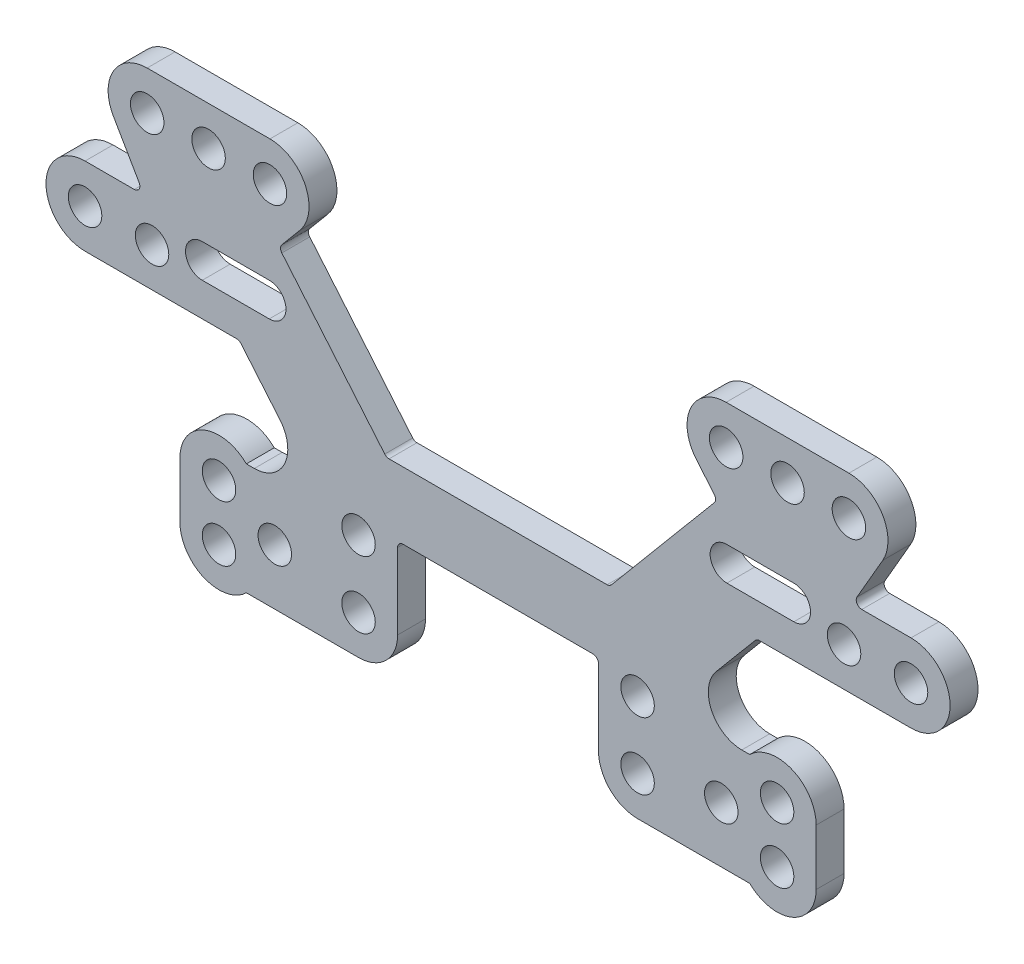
ISO-10303-21;
HEADER;
FILE_DESCRIPTION(('STEP AP214'),'2;1');
FILE_NAME('part.step','',(''),(''),'','','');
FILE_SCHEMA(('AUTOMOTIVE_DESIGN { 1 0 10303 214 1 1 1 1 }'));
ENDSEC;
DATA;
#1=APPLICATION_CONTEXT('core data for automotive mechanical design processes');
#2=APPLICATION_PROTOCOL_DEFINITION('international standard','automotive_design',2000,#1);
#3=PRODUCT_CONTEXT('',#1,'mechanical');
#4=PRODUCT('Part','Part','',(#3));
#5=PRODUCT_RELATED_PRODUCT_CATEGORY('part','',(#4));
#6=PRODUCT_DEFINITION_FORMATION('','',#4);
#7=PRODUCT_DEFINITION_CONTEXT('part definition',#1,'design');
#8=PRODUCT_DEFINITION('design','',#6,#7);
#9=PRODUCT_DEFINITION_SHAPE('','',#8);
#10=(LENGTH_UNIT() NAMED_UNIT(*) SI_UNIT(.MILLI.,.METRE.));
#11=(NAMED_UNIT(*) PLANE_ANGLE_UNIT() SI_UNIT($,.RADIAN.));
#12=(NAMED_UNIT(*) SI_UNIT($,.STERADIAN.) SOLID_ANGLE_UNIT());
#13=UNCERTAINTY_MEASURE_WITH_UNIT(LENGTH_MEASURE(1.E-05),#10,'distance_accuracy_value','');
#14=(GEOMETRIC_REPRESENTATION_CONTEXT(3) GLOBAL_UNCERTAINTY_ASSIGNED_CONTEXT((#13)) GLOBAL_UNIT_ASSIGNED_CONTEXT((#10,
#11,#12)) REPRESENTATION_CONTEXT('',''));
#15=CARTESIAN_POINT('',(0.,0.,0.));
#16=DIRECTION('',(0.,0.,1.));
#17=DIRECTION('',(1.,0.,0.));
#18=AXIS2_PLACEMENT_3D('',#15,#16,#17);
#19=CARTESIAN_POINT('',(0.52816283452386,-3.3786252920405,0.));
#20=DIRECTION('',(0.,0.,-1.));
#21=DIRECTION('',(-1.,0.,0.));
#22=AXIS2_PLACEMENT_3D('',#19,#20,#21);
#23=CYLINDRICAL_SURFACE('',#22,3.49999999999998);
#24=CARTESIAN_POINT('',(0.52816283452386,-3.3786252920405,-2.5));
#25=DIRECTION('',(0.,0.,-1.));
#26=DIRECTION('',(-1.,0.,0.));
#27=AXIS2_PLACEMENT_3D('',#24,#25,#26);
#28=CIRCLE('',#27,3.49999999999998);
#29=CARTESIAN_POINT('',(0.528162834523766,-6.87862529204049,-2.5));
#30=VERTEX_POINT('',#29);
#31=CARTESIAN_POINT('',(-2.97183716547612,-3.3786252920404,-2.5));
#32=VERTEX_POINT('',#31);
#33=EDGE_CURVE('E825',#30,#32,#28,.T.);
#34=ORIENTED_EDGE('',*,*,#33,.F.);
#35=DIRECTION('',(0.,0.,-1.));
#36=VECTOR('',#35,1.);
#37=CARTESIAN_POINT('',(0.528162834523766,-6.87862529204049,0.));
#38=LINE('',#37,#36);
#39=CARTESIAN_POINT('',(0.528162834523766,-6.87862529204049,0.));
#40=VERTEX_POINT('',#39);
#41=EDGE_CURVE('E11',#40,#30,#38,.T.);
#42=ORIENTED_EDGE('',*,*,#41,.F.);
#43=CARTESIAN_POINT('',(0.52816283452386,-3.3786252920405,0.));
#44=DIRECTION('',(0.,0.,-1.));
#45=DIRECTION('',(-1.,0.,0.));
#46=AXIS2_PLACEMENT_3D('',#43,#44,#45);
#47=CIRCLE('',#46,3.49999999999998);
#48=CARTESIAN_POINT('',(-2.97183716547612,-3.3786252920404,0.));
#49=VERTEX_POINT('',#48);
#50=EDGE_CURVE('E975',#40,#49,#47,.T.);
#51=ORIENTED_EDGE('',*,*,#50,.T.);
#52=DIRECTION('',(0.,0.,-1.));
#53=VECTOR('',#52,1.);
#54=CARTESIAN_POINT('',(-2.97183716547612,-3.3786252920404,0.));
#55=LINE('',#54,#53);
#56=EDGE_CURVE('E353',#49,#32,#55,.T.);
#57=ORIENTED_EDGE('',*,*,#56,.T.);
#58=EDGE_LOOP('',(#34,#42,#51,#57));
#59=FACE_BOUND('',#58,.T.);
#60=ADVANCED_FACE('F350',(#59),#23,.T.);
#61=CARTESIAN_POINT('',(10.5786730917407,-6.87862529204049,0.));
#62=DIRECTION('',(0.,-1.,0.));
#63=DIRECTION('',(1.,0.,0.));
#64=AXIS2_PLACEMENT_3D('',#61,#62,#63);
#65=PLANE('',#64);
#66=DIRECTION('',(-1.,0.,0.));
#67=VECTOR('',#66,1.);
#68=CARTESIAN_POINT('',(10.5786730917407,-6.87862529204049,-2.5));
#69=LINE('',#68,#67);
#70=CARTESIAN_POINT('',(10.5786730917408,-6.87862529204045,-2.5));
#71=VERTEX_POINT('',#70);
#72=EDGE_CURVE('E972',#71,#30,#69,.T.);
#73=ORIENTED_EDGE('',*,*,#72,.F.);
#74=DIRECTION('',(0.,0.,-1.));
#75=VECTOR('',#74,1.);
#76=CARTESIAN_POINT('',(10.5786730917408,-6.87862529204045,0.));
#77=LINE('',#76,#75);
#78=CARTESIAN_POINT('',(10.5786730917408,-6.87862529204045,0.));
#79=VERTEX_POINT('',#78);
#80=EDGE_CURVE('E358',#79,#71,#77,.T.);
#81=ORIENTED_EDGE('',*,*,#80,.F.);
#82=DIRECTION('',(-1.,0.,0.));
#83=VECTOR('',#82,1.);
#84=CARTESIAN_POINT('',(10.5786730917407,-6.87862529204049,0.));
#85=LINE('',#84,#83);
#86=EDGE_CURVE('E1116',#79,#40,#85,.T.);
#87=ORIENTED_EDGE('',*,*,#86,.T.);
#88=ORIENTED_EDGE('',*,*,#41,.T.);
#89=EDGE_LOOP('',(#73,#81,#87,#88));
#90=FACE_BOUND('',#89,.T.);
#91=ADVANCED_FACE('F1220',(#90),#65,.T.);
#92=CARTESIAN_POINT('',(13.028162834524,-4.3786252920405,0.));
#93=DIRECTION('',(0.,0.,-1.));
#94=DIRECTION('',(-1.,0.,0.));
#95=AXIS2_PLACEMENT_3D('',#92,#93,#94);
#96=CYLINDRICAL_SURFACE('',#95,3.49999999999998);
#97=CARTESIAN_POINT('',(13.028162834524,-4.3786252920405,-2.5));
#98=DIRECTION('',(0.,0.,-1.));
#99=DIRECTION('',(-1.,0.,0.));
#100=AXIS2_PLACEMENT_3D('',#97,#98,#99);
#101=CIRCLE('',#100,3.49999999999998);
#102=CARTESIAN_POINT('',(16.5281628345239,-4.3786252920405,-2.5));
#103=VERTEX_POINT('',#102);
#104=EDGE_CURVE('E969',#103,#71,#101,.T.);
#105=ORIENTED_EDGE('',*,*,#104,.F.);
#106=DIRECTION('',(0.,0.,-1.));
#107=VECTOR('',#106,1.);
#108=CARTESIAN_POINT('',(16.5281628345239,-4.3786252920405,0.));
#109=LINE('',#108,#107);
#110=CARTESIAN_POINT('',(16.5281628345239,-4.3786252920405,0.));
#111=VERTEX_POINT('',#110);
#112=EDGE_CURVE('E1120',#111,#103,#109,.T.);
#113=ORIENTED_EDGE('',*,*,#112,.F.);
#114=CARTESIAN_POINT('',(13.028162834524,-4.3786252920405,0.));
#115=DIRECTION('',(0.,0.,-1.));
#116=DIRECTION('',(-1.,0.,0.));
#117=AXIS2_PLACEMENT_3D('',#114,#115,#116);
#118=CIRCLE('',#117,3.49999999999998);
#119=EDGE_CURVE('E1113',#111,#79,#118,.T.);
#120=ORIENTED_EDGE('',*,*,#119,.T.);
#121=ORIENTED_EDGE('',*,*,#80,.T.);
#122=EDGE_LOOP('',(#105,#113,#120,#121));
#123=FACE_BOUND('',#122,.T.);
#124=ADVANCED_FACE('F1401',(#123),#96,.T.);
#125=CARTESIAN_POINT('',(16.528162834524,0.621374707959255,0.));
#126=DIRECTION('',(1.,0.,0.));
#127=DIRECTION('',(0.,1.,0.));
#128=AXIS2_PLACEMENT_3D('',#125,#126,#127);
#129=PLANE('',#128);
#130=DIRECTION('',(0.,-1.,0.));
#131=VECTOR('',#130,1.);
#132=CARTESIAN_POINT('',(16.528162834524,0.621374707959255,-2.5));
#133=LINE('',#132,#131);
#134=CARTESIAN_POINT('',(16.5281628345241,0.621374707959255,-2.5));
#135=VERTEX_POINT('',#134);
#136=EDGE_CURVE('E966',#135,#103,#133,.T.);
#137=ORIENTED_EDGE('',*,*,#136,.F.);
#138=DIRECTION('',(0.,0.,-1.));
#139=VECTOR('',#138,1.);
#140=CARTESIAN_POINT('',(16.5281628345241,0.621374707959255,0.));
#141=LINE('',#140,#139);
#142=CARTESIAN_POINT('',(16.5281628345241,0.621374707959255,0.));
#143=VERTEX_POINT('',#142);
#144=EDGE_CURVE('E1122',#143,#135,#141,.T.);
#145=ORIENTED_EDGE('',*,*,#144,.F.);
#146=DIRECTION('',(0.,-1.,0.));
#147=VECTOR('',#146,1.);
#148=CARTESIAN_POINT('',(16.528162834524,0.621374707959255,0.));
#149=LINE('',#148,#147);
#150=EDGE_CURVE('E1110',#143,#111,#149,.T.);
#151=ORIENTED_EDGE('',*,*,#150,.T.);
#152=ORIENTED_EDGE('',*,*,#112,.T.);
#153=EDGE_LOOP('',(#137,#145,#151,#152));
#154=FACE_BOUND('',#153,.T.);
#155=ADVANCED_FACE('F1398',(#154),#129,.T.);
#156=CARTESIAN_POINT('',(13.028162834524,0.62137470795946,0.));
#157=DIRECTION('',(0.,0.,-1.));
#158=DIRECTION('',(-1.,0.,0.));
#159=AXIS2_PLACEMENT_3D('',#156,#157,#158);
#160=CYLINDRICAL_SURFACE('',#159,3.50000000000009);
#161=CARTESIAN_POINT('',(13.028162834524,0.62137470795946,-2.5));
#162=DIRECTION('',(0.,0.,-1.));
#163=DIRECTION('',(-1.,0.,0.));
#164=AXIS2_PLACEMENT_3D('',#161,#162,#163);
#165=CIRCLE('',#164,3.50000000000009);
#166=CARTESIAN_POINT('',(10.5786730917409,3.12137470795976,-2.5));
#167=VERTEX_POINT('',#166);
#168=EDGE_CURVE('E963',#167,#135,#165,.T.);
#169=ORIENTED_EDGE('',*,*,#168,.F.);
#170=DIRECTION('',(0.,0.,-1.));
#171=VECTOR('',#170,1.);
#172=CARTESIAN_POINT('',(10.5786730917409,3.12137470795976,0.));
#173=LINE('',#172,#171);
#174=CARTESIAN_POINT('',(10.5786730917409,3.12137470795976,0.));
#175=VERTEX_POINT('',#174);
#176=EDGE_CURVE('E1124',#175,#167,#173,.T.);
#177=ORIENTED_EDGE('',*,*,#176,.F.);
#178=CARTESIAN_POINT('',(13.028162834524,0.62137470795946,0.));
#179=DIRECTION('',(0.,0.,-1.));
#180=DIRECTION('',(-1.,0.,0.));
#181=AXIS2_PLACEMENT_3D('',#178,#179,#180);
#182=CIRCLE('',#181,3.50000000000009);
#183=EDGE_CURVE('E1107',#175,#143,#182,.T.);
#184=ORIENTED_EDGE('',*,*,#183,.T.);
#185=ORIENTED_EDGE('',*,*,#144,.T.);
#186=EDGE_LOOP('',(#169,#177,#184,#185));
#187=FACE_BOUND('',#186,.T.);
#188=ADVANCED_FACE('F1395',(#187),#160,.T.);
#189=CARTESIAN_POINT('',(9.86548181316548,3.1213747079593,0.));
#190=DIRECTION('',(-6.49434705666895E-13,1.,0.));
#191=DIRECTION('',(-1.,-6.49434705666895E-13,0.));
#192=AXIS2_PLACEMENT_3D('',#189,#190,#191);
#193=PLANE('',#192);
#194=DIRECTION('',(1.,6.49434705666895E-13,0.));
#195=VECTOR('',#194,1.);
#196=CARTESIAN_POINT('',(9.86548181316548,3.1213747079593,-2.5));
#197=LINE('',#196,#195);
#198=CARTESIAN_POINT('',(9.86548181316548,3.12137470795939,-2.5));
#199=VERTEX_POINT('',#198);
#200=EDGE_CURVE('E960',#199,#167,#197,.T.);
#201=ORIENTED_EDGE('',*,*,#200,.F.);
#202=DIRECTION('',(0.,0.,-1.));
#203=VECTOR('',#202,1.);
#204=CARTESIAN_POINT('',(9.86548181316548,3.12137470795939,0.));
#205=LINE('',#204,#203);
#206=CARTESIAN_POINT('',(9.86548181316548,3.12137470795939,0.));
#207=VERTEX_POINT('',#206);
#208=EDGE_CURVE('E1126',#207,#199,#205,.T.);
#209=ORIENTED_EDGE('',*,*,#208,.F.);
#210=DIRECTION('',(1.,6.49434705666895E-13,0.));
#211=VECTOR('',#210,1.);
#212=CARTESIAN_POINT('',(9.86548181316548,3.1213747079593,0.));
#213=LINE('',#212,#211);
#214=EDGE_CURVE('E1104',#207,#175,#213,.T.);
#215=ORIENTED_EDGE('',*,*,#214,.T.);
#216=ORIENTED_EDGE('',*,*,#176,.T.);
#217=EDGE_LOOP('',(#201,#209,#215,#216));
#218=FACE_BOUND('',#217,.T.);
#219=ADVANCED_FACE('F1391',(#218),#193,.T.);
#220=CARTESIAN_POINT('',(9.86548181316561,6.1213747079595,0.));
#221=DIRECTION('',(0.,0.,-1.));
#222=DIRECTION('',(-1.,0.,0.));
#223=AXIS2_PLACEMENT_3D('',#220,#221,#222);
#224=CYLINDRICAL_SURFACE('',#223,3.00000000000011);
#225=CARTESIAN_POINT('',(9.86548181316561,6.1213747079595,-2.5));
#226=DIRECTION('',(0.,0.,1.));
#227=DIRECTION('',(1.,0.,0.));
#228=AXIS2_PLACEMENT_3D('',#225,#226,#227);
#229=CIRCLE('',#228,3.00000000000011);
#230=CARTESIAN_POINT('',(7.56734848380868,8.04973753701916,-2.5));
#231=VERTEX_POINT('',#230);
#232=EDGE_CURVE('E957',#231,#199,#229,.T.);
#233=ORIENTED_EDGE('',*,*,#232,.F.);
#234=DIRECTION('',(0.,0.,-1.));
#235=VECTOR('',#234,1.);
#236=CARTESIAN_POINT('',(7.56734848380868,8.04973753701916,0.));
#237=LINE('',#236,#235);
#238=CARTESIAN_POINT('',(7.56734848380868,8.04973753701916,0.));
#239=VERTEX_POINT('',#238);
#240=EDGE_CURVE('E1128',#239,#231,#237,.T.);
#241=ORIENTED_EDGE('',*,*,#240,.F.);
#242=CARTESIAN_POINT('',(9.86548181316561,6.1213747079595,0.));
#243=DIRECTION('',(0.,0.,1.));
#244=DIRECTION('',(1.,0.,0.));
#245=AXIS2_PLACEMENT_3D('',#242,#243,#244);
#246=CIRCLE('',#245,3.00000000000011);
#247=EDGE_CURVE('E1101',#239,#207,#246,.T.);
#248=ORIENTED_EDGE('',*,*,#247,.T.);
#249=ORIENTED_EDGE('',*,*,#208,.T.);
#250=EDGE_LOOP('',(#233,#241,#248,#249));
#251=FACE_BOUND('',#250,.T.);
#252=ADVANCED_FACE('F1387',(#251),#224,.F.);
#253=CARTESIAN_POINT('',(11.064173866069,12.217091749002,0.));
#254=DIRECTION('',(0.766044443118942,-0.642787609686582,0.));
#255=DIRECTION('',(0.642787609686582,0.766044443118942,0.));
#256=AXIS2_PLACEMENT_3D('',#253,#254,#255);
#257=PLANE('',#256);
#258=DIRECTION('',(-0.642787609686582,-0.766044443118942,0.));
#259=VECTOR('',#258,1.);
#260=CARTESIAN_POINT('',(11.064173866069,12.217091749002,-2.5));
#261=LINE('',#260,#259);
#262=CARTESIAN_POINT('',(11.0641738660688,12.2170917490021,-2.5));
#263=VERTEX_POINT('',#262);
#264=EDGE_CURVE('E954',#263,#231,#261,.T.);
#265=ORIENTED_EDGE('',*,*,#264,.F.);
#266=DIRECTION('',(0.,0.,-1.));
#267=VECTOR('',#266,1.);
#268=CARTESIAN_POINT('',(11.0641738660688,12.2170917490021,0.));
#269=LINE('',#268,#267);
#270=CARTESIAN_POINT('',(11.0641738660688,12.2170917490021,0.));
#271=VERTEX_POINT('',#270);
#272=EDGE_CURVE('E1130',#271,#263,#269,.T.);
#273=ORIENTED_EDGE('',*,*,#272,.F.);
#274=DIRECTION('',(-0.642787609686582,-0.766044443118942,0.));
#275=VECTOR('',#274,1.);
#276=CARTESIAN_POINT('',(11.064173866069,12.217091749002,0.));
#277=LINE('',#276,#275);
#278=EDGE_CURVE('E1098',#271,#239,#277,.T.);
#279=ORIENTED_EDGE('',*,*,#278,.T.);
#280=ORIENTED_EDGE('',*,*,#240,.T.);
#281=EDGE_LOOP('',(#265,#273,#279,#280));
#282=FACE_BOUND('',#281,.T.);
#283=ADVANCED_FACE('F1383',(#282),#257,.T.);
#284=CARTESIAN_POINT('',(11.447196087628,11.895697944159,0.));
#285=DIRECTION('',(0.,0.,-1.));
#286=DIRECTION('',(-1.,0.,0.));
#287=AXIS2_PLACEMENT_3D('',#284,#285,#286);
#288=CYLINDRICAL_SURFACE('',#287,0.499999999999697);
#289=CARTESIAN_POINT('',(11.447196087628,11.895697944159,-2.5));
#290=DIRECTION('',(0.,0.,1.));
#291=DIRECTION('',(1.,0.,0.));
#292=AXIS2_PLACEMENT_3D('',#289,#290,#291);
#293=CIRCLE('',#292,0.499999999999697);
#294=CARTESIAN_POINT('',(11.447196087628,12.3956979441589,-2.5));
#295=VERTEX_POINT('',#294);
#296=EDGE_CURVE('E951',#295,#263,#293,.T.);
#297=ORIENTED_EDGE('',*,*,#296,.F.);
#298=DIRECTION('',(0.,0.,-1.));
#299=VECTOR('',#298,1.);
#300=CARTESIAN_POINT('',(11.447196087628,12.3956979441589,0.));
#301=LINE('',#300,#299);
#302=CARTESIAN_POINT('',(11.447196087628,12.3956979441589,0.));
#303=VERTEX_POINT('',#302);
#304=EDGE_CURVE('E1132',#303,#295,#301,.T.);
#305=ORIENTED_EDGE('',*,*,#304,.F.);
#306=CARTESIAN_POINT('',(11.447196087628,11.895697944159,0.));
#307=DIRECTION('',(0.,0.,1.));
#308=DIRECTION('',(1.,0.,0.));
#309=AXIS2_PLACEMENT_3D('',#306,#307,#308);
#310=CIRCLE('',#309,0.499999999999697);
#311=EDGE_CURVE('E1095',#303,#271,#310,.T.);
#312=ORIENTED_EDGE('',*,*,#311,.T.);
#313=ORIENTED_EDGE('',*,*,#272,.T.);
#314=EDGE_LOOP('',(#297,#305,#312,#313));
#315=FACE_BOUND('',#314,.T.);
#316=ADVANCED_FACE('F1379',(#315),#288,.F.);
#317=CARTESIAN_POINT('',(25.028162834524,12.3956979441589,0.));
#318=DIRECTION('',(0.,-1.,0.));
#319=DIRECTION('',(0.,0.,-1.));
#320=AXIS2_PLACEMENT_3D('',#317,#318,#319);
#321=PLANE('',#320);
#322=DIRECTION('',(-1.,0.,0.));
#323=VECTOR('',#322,1.);
#324=CARTESIAN_POINT('',(25.028162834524,12.3956979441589,-2.5));
#325=LINE('',#324,#323);
#326=CARTESIAN_POINT('',(25.028162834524,12.395697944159,-2.5));
#327=VERTEX_POINT('',#326);
#328=EDGE_CURVE('E948',#327,#295,#325,.T.);
#329=ORIENTED_EDGE('',*,*,#328,.F.);
#330=DIRECTION('',(0.,0.,-1.));
#331=VECTOR('',#330,1.);
#332=CARTESIAN_POINT('',(25.028162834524,12.395697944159,0.));
#333=LINE('',#332,#331);
#334=CARTESIAN_POINT('',(25.028162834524,12.395697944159,0.));
#335=VERTEX_POINT('',#334);
#336=EDGE_CURVE('E1134',#335,#327,#333,.T.);
#337=ORIENTED_EDGE('',*,*,#336,.F.);
#338=DIRECTION('',(-1.,0.,0.));
#339=VECTOR('',#338,1.);
#340=CARTESIAN_POINT('',(25.028162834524,12.3956979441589,0.));
#341=LINE('',#340,#339);
#342=EDGE_CURVE('E1092',#335,#303,#341,.T.);
#343=ORIENTED_EDGE('',*,*,#342,.T.);
#344=ORIENTED_EDGE('',*,*,#304,.T.);
#345=EDGE_LOOP('',(#329,#337,#343,#344));
#346=FACE_BOUND('',#345,.T.);
#347=ADVANCED_FACE('F1375',(#346),#321,.T.);
#348=CARTESIAN_POINT('',(25.028162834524,15.895697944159,0.));
#349=DIRECTION('',(0.,0.,-1.));
#350=DIRECTION('',(-1.,0.,0.));
#351=AXIS2_PLACEMENT_3D('',#348,#349,#350);
#352=CYLINDRICAL_SURFACE('',#351,3.49999999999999);
#353=CARTESIAN_POINT('',(25.028162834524,15.895697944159,-2.5));
#354=DIRECTION('',(0.,0.,-1.));
#355=DIRECTION('',(-1.,0.,0.));
#356=AXIS2_PLACEMENT_3D('',#353,#354,#355);
#357=CIRCLE('',#356,3.49999999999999);
#358=CARTESIAN_POINT('',(25.028162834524,19.3956979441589,-2.5));
#359=VERTEX_POINT('',#358);
#360=EDGE_CURVE('E945',#359,#327,#357,.T.);
#361=ORIENTED_EDGE('',*,*,#360,.F.);
#362=DIRECTION('',(0.,0.,-1.));
#363=VECTOR('',#362,1.);
#364=CARTESIAN_POINT('',(25.028162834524,19.3956979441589,0.));
#365=LINE('',#364,#363);
#366=CARTESIAN_POINT('',(25.028162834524,19.3956979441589,0.));
#367=VERTEX_POINT('',#366);
#368=EDGE_CURVE('E1136',#367,#359,#365,.T.);
#369=ORIENTED_EDGE('',*,*,#368,.F.);
#370=CARTESIAN_POINT('',(25.028162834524,15.895697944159,0.));
#371=DIRECTION('',(0.,0.,-1.));
#372=DIRECTION('',(-1.,0.,0.));
#373=AXIS2_PLACEMENT_3D('',#370,#371,#372);
#374=CIRCLE('',#373,3.49999999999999);
#375=EDGE_CURVE('E1089',#367,#335,#374,.T.);
#376=ORIENTED_EDGE('',*,*,#375,.T.);
#377=ORIENTED_EDGE('',*,*,#336,.T.);
#378=EDGE_LOOP('',(#361,#369,#376,#377));
#379=FACE_BOUND('',#378,.T.);
#380=ADVANCED_FACE('F1371',(#379),#352,.T.);
#381=CARTESIAN_POINT('',(20.617654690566,19.3956979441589,0.));
#382=DIRECTION('',(0.,1.,0.));
#383=DIRECTION('',(0.,0.,1.));
#384=AXIS2_PLACEMENT_3D('',#381,#382,#383);
#385=PLANE('',#384);
#386=DIRECTION('',(1.,0.,0.));
#387=VECTOR('',#386,1.);
#388=CARTESIAN_POINT('',(20.617654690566,19.3956979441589,-2.5));
#389=LINE('',#388,#387);
#390=CARTESIAN_POINT('',(20.617654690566,19.3956979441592,-2.5));
#391=VERTEX_POINT('',#390);
#392=EDGE_CURVE('E942',#391,#359,#389,.T.);
#393=ORIENTED_EDGE('',*,*,#392,.F.);
#394=DIRECTION('',(0.,0.,-1.));
#395=VECTOR('',#394,1.);
#396=CARTESIAN_POINT('',(20.617654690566,19.3956979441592,0.));
#397=LINE('',#396,#395);
#398=CARTESIAN_POINT('',(20.617654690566,19.3956979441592,0.));
#399=VERTEX_POINT('',#398);
#400=EDGE_CURVE('E1138',#399,#391,#397,.T.);
#401=ORIENTED_EDGE('',*,*,#400,.F.);
#402=DIRECTION('',(1.,0.,0.));
#403=VECTOR('',#402,1.);
#404=CARTESIAN_POINT('',(20.617654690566,19.3956979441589,0.));
#405=LINE('',#404,#403);
#406=EDGE_CURVE('E1086',#399,#367,#405,.T.);
#407=ORIENTED_EDGE('',*,*,#406,.T.);
#408=ORIENTED_EDGE('',*,*,#368,.T.);
#409=EDGE_LOOP('',(#393,#401,#407,#408));
#410=FACE_BOUND('',#409,.T.);
#411=ADVANCED_FACE('F1367',(#410),#385,.T.);
#412=CARTESIAN_POINT('',(20.617654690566,19.895697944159,0.));
#413=DIRECTION('',(0.,0.,-1.));
#414=DIRECTION('',(-1.,0.,0.));
#415=AXIS2_PLACEMENT_3D('',#412,#413,#414);
#416=CYLINDRICAL_SURFACE('',#415,0.49999999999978);
#417=CARTESIAN_POINT('',(20.617654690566,19.895697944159,-2.5));
#418=DIRECTION('',(0.,0.,1.));
#419=DIRECTION('',(1.,0.,0.));
#420=AXIS2_PLACEMENT_3D('',#417,#418,#419);
#421=CIRCLE('',#420,0.49999999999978);
#422=CARTESIAN_POINT('',(20.1846419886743,20.1456979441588,-2.5));
#423=VERTEX_POINT('',#422);
#424=EDGE_CURVE('E939',#423,#391,#421,.T.);
#425=ORIENTED_EDGE('',*,*,#424,.F.);
#426=DIRECTION('',(0.,0.,-1.));
#427=VECTOR('',#426,1.);
#428=CARTESIAN_POINT('',(20.1846419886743,20.1456979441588,0.));
#429=LINE('',#428,#427);
#430=CARTESIAN_POINT('',(20.1846419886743,20.1456979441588,0.));
#431=VERTEX_POINT('',#430);
#432=EDGE_CURVE('E1140',#431,#423,#429,.T.);
#433=ORIENTED_EDGE('',*,*,#432,.F.);
#434=CARTESIAN_POINT('',(20.617654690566,19.895697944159,0.));
#435=DIRECTION('',(0.,0.,1.));
#436=DIRECTION('',(1.,0.,0.));
#437=AXIS2_PLACEMENT_3D('',#434,#435,#436);
#438=CIRCLE('',#437,0.49999999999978);
#439=EDGE_CURVE('E1083',#431,#399,#438,.T.);
#440=ORIENTED_EDGE('',*,*,#439,.T.);
#441=ORIENTED_EDGE('',*,*,#400,.T.);
#442=EDGE_LOOP('',(#425,#433,#440,#441));
#443=FACE_BOUND('',#442,.T.);
#444=ADVANCED_FACE('F1363',(#443),#416,.F.);
#445=CARTESIAN_POINT('',(22.4940430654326,24.1456979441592,0.));
#446=DIRECTION('',(0.866025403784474,-0.499999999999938,0.));
#447=DIRECTION('',(0.499999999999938,0.866025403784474,0.));
#448=AXIS2_PLACEMENT_3D('',#445,#446,#447);
#449=PLANE('',#448);
#450=DIRECTION('',(-0.499999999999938,-0.866025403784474,0.));
#451=VECTOR('',#450,1.);
#452=CARTESIAN_POINT('',(22.4940430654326,24.1456979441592,-2.5));
#453=LINE('',#452,#451);
#454=CARTESIAN_POINT('',(22.4940430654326,24.1456979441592,-2.5));
#455=VERTEX_POINT('',#454);
#456=EDGE_CURVE('E936',#455,#423,#453,.T.);
#457=ORIENTED_EDGE('',*,*,#456,.F.);
#458=DIRECTION('',(0.,0.,-1.));
#459=VECTOR('',#458,1.);
#460=CARTESIAN_POINT('',(22.4940430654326,24.1456979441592,0.));
#461=LINE('',#460,#459);
#462=CARTESIAN_POINT('',(22.4940430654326,24.1456979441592,0.));
#463=VERTEX_POINT('',#462);
#464=EDGE_CURVE('E1142',#463,#455,#461,.T.);
#465=ORIENTED_EDGE('',*,*,#464,.F.);
#466=DIRECTION('',(-0.499999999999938,-0.866025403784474,0.));
#467=VECTOR('',#466,1.);
#468=CARTESIAN_POINT('',(22.4940430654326,24.1456979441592,0.));
#469=LINE('',#468,#467);
#470=EDGE_CURVE('E1080',#463,#431,#469,.T.);
#471=ORIENTED_EDGE('',*,*,#470,.T.);
#472=ORIENTED_EDGE('',*,*,#432,.T.);
#473=EDGE_LOOP('',(#457,#465,#471,#472));
#474=FACE_BOUND('',#473,.T.);
#475=ADVANCED_FACE('F1359',(#474),#449,.T.);
#476=CARTESIAN_POINT('',(19.462954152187,25.895697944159,0.));
#477=DIRECTION('',(0.,0.,-1.));
#478=DIRECTION('',(-1.,0.,0.));
#479=AXIS2_PLACEMENT_3D('',#476,#477,#478);
#480=CYLINDRICAL_SURFACE('',#479,3.49999999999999);
#481=CARTESIAN_POINT('',(19.462954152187,25.895697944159,-2.5));
#482=DIRECTION('',(0.,0.,-1.));
#483=DIRECTION('',(-1.,0.,0.));
#484=AXIS2_PLACEMENT_3D('',#481,#482,#483);
#485=CIRCLE('',#484,3.49999999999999);
#486=CARTESIAN_POINT('',(19.462954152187,29.395697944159,-2.5));
#487=VERTEX_POINT('',#486);
#488=EDGE_CURVE('E933',#487,#455,#485,.T.);
#489=ORIENTED_EDGE('',*,*,#488,.F.);
#490=DIRECTION('',(0.,0.,-1.));
#491=VECTOR('',#490,1.);
#492=CARTESIAN_POINT('',(19.462954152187,29.395697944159,0.));
#493=LINE('',#492,#491);
#494=CARTESIAN_POINT('',(19.462954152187,29.395697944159,0.));
#495=VERTEX_POINT('',#494);
#496=EDGE_CURVE('E1144',#495,#487,#493,.T.);
#497=ORIENTED_EDGE('',*,*,#496,.F.);
#498=CARTESIAN_POINT('',(19.462954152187,25.895697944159,0.));
#499=DIRECTION('',(0.,0.,-1.));
#500=DIRECTION('',(-1.,0.,0.));
#501=AXIS2_PLACEMENT_3D('',#498,#499,#500);
#502=CIRCLE('',#501,3.49999999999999);
#503=EDGE_CURVE('E1077',#495,#463,#502,.T.);
#504=ORIENTED_EDGE('',*,*,#503,.T.);
#505=ORIENTED_EDGE('',*,*,#464,.T.);
#506=EDGE_LOOP('',(#489,#497,#504,#505));
#507=FACE_BOUND('',#506,.T.);
#508=ADVANCED_FACE('F1355',(#507),#480,.T.);
#509=CARTESIAN_POINT('',(8.46295415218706,29.3956979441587,0.));
#510=DIRECTION('',(0.,1.,0.));
#511=DIRECTION('',(-1.,0.,0.));
#512=AXIS2_PLACEMENT_3D('',#509,#510,#511);
#513=PLANE('',#512);
#514=DIRECTION('',(1.,0.,0.));
#515=VECTOR('',#514,1.);
#516=CARTESIAN_POINT('',(8.46295415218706,29.3956979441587,-2.5));
#517=LINE('',#516,#515);
#518=CARTESIAN_POINT('',(8.46295415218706,29.3956979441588,-2.5));
#519=VERTEX_POINT('',#518);
#520=EDGE_CURVE('E930',#519,#487,#517,.T.);
#521=ORIENTED_EDGE('',*,*,#520,.F.);
#522=DIRECTION('',(0.,0.,-1.));
#523=VECTOR('',#522,1.);
#524=CARTESIAN_POINT('',(8.46295415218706,29.3956979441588,0.));
#525=LINE('',#524,#523);
#526=CARTESIAN_POINT('',(8.46295415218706,29.3956979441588,0.));
#527=VERTEX_POINT('',#526);
#528=EDGE_CURVE('E1146',#527,#519,#525,.T.);
#529=ORIENTED_EDGE('',*,*,#528,.F.);
#530=DIRECTION('',(1.,0.,0.));
#531=VECTOR('',#530,1.);
#532=CARTESIAN_POINT('',(8.46295415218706,29.3956979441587,0.));
#533=LINE('',#532,#531);
#534=EDGE_CURVE('E1074',#527,#495,#533,.T.);
#535=ORIENTED_EDGE('',*,*,#534,.T.);
#536=ORIENTED_EDGE('',*,*,#496,.T.);
#537=EDGE_LOOP('',(#521,#529,#535,#536));
#538=FACE_BOUND('',#537,.T.);
#539=ADVANCED_FACE('F1351',(#538),#513,.T.);
#540=CARTESIAN_POINT('',(8.4629541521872,25.895697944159,0.));
#541=DIRECTION('',(0.,0.,-1.));
#542=DIRECTION('',(-1.,0.,0.));
#543=AXIS2_PLACEMENT_3D('',#540,#541,#542);
#544=CYLINDRICAL_SURFACE('',#543,3.4999999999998);
#545=CARTESIAN_POINT('',(8.4629541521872,25.895697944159,-2.5));
#546=DIRECTION('',(0.,0.,-1.));
#547=DIRECTION('',(-1.,0.,0.));
#548=AXIS2_PLACEMENT_3D('',#545,#546,#547);
#549=CIRCLE('',#548,3.4999999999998);
#550=CARTESIAN_POINT('',(5.78179860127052,23.6459413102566,-2.5));
#551=VERTEX_POINT('',#550);
#552=EDGE_CURVE('E927',#551,#519,#549,.T.);
#553=ORIENTED_EDGE('',*,*,#552,.F.);
#554=DIRECTION('',(0.,0.,-1.));
#555=VECTOR('',#554,1.);
#556=CARTESIAN_POINT('',(5.78179860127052,23.6459413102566,0.));
#557=LINE('',#556,#555);
#558=CARTESIAN_POINT('',(5.78179860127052,23.6459413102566,0.));
#559=VERTEX_POINT('',#558);
#560=EDGE_CURVE('E1148',#559,#551,#557,.T.);
#561=ORIENTED_EDGE('',*,*,#560,.F.);
#562=CARTESIAN_POINT('',(8.4629541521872,25.895697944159,0.));
#563=DIRECTION('',(0.,0.,-1.));
#564=DIRECTION('',(-1.,0.,0.));
#565=AXIS2_PLACEMENT_3D('',#562,#563,#564);
#566=CIRCLE('',#565,3.4999999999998);
#567=EDGE_CURVE('E1071',#559,#527,#566,.T.);
#568=ORIENTED_EDGE('',*,*,#567,.T.);
#569=ORIENTED_EDGE('',*,*,#528,.T.);
#570=EDGE_LOOP('',(#553,#561,#568,#569));
#571=FACE_BOUND('',#570,.T.);
#572=ADVANCED_FACE('F1347',(#571),#544,.T.);
#573=CARTESIAN_POINT('',(7.40029555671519,21.7170917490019,0.));
#574=DIRECTION('',(-0.766044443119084,-0.642787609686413,0.));
#575=DIRECTION('',(0.642787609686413,-0.766044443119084,0.));
#576=AXIS2_PLACEMENT_3D('',#573,#574,#575);
#577=PLANE('',#576);
#578=DIRECTION('',(-0.642787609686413,0.766044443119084,0.));
#579=VECTOR('',#578,1.);
#580=CARTESIAN_POINT('',(7.40029555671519,21.7170917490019,-2.5));
#581=LINE('',#580,#579);
#582=CARTESIAN_POINT('',(7.40029555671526,21.717091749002,-2.5));
#583=VERTEX_POINT('',#582);
#584=EDGE_CURVE('E924',#583,#551,#581,.T.);
#585=ORIENTED_EDGE('',*,*,#584,.F.);
#586=DIRECTION('',(0.,0.,-1.));
#587=VECTOR('',#586,1.);
#588=CARTESIAN_POINT('',(7.40029555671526,21.717091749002,0.));
#589=LINE('',#588,#587);
#590=CARTESIAN_POINT('',(7.40029555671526,21.717091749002,0.));
#591=VERTEX_POINT('',#590);
#592=EDGE_CURVE('E1150',#591,#583,#589,.T.);
#593=ORIENTED_EDGE('',*,*,#592,.F.);
#594=DIRECTION('',(-0.642787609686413,0.766044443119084,0.));
#595=VECTOR('',#594,1.);
#596=CARTESIAN_POINT('',(7.40029555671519,21.7170917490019,0.));
#597=LINE('',#596,#595);
#598=EDGE_CURVE('E1068',#591,#559,#597,.T.);
#599=ORIENTED_EDGE('',*,*,#598,.T.);
#600=ORIENTED_EDGE('',*,*,#560,.T.);
#601=EDGE_LOOP('',(#585,#593,#599,#600));
#602=FACE_BOUND('',#601,.T.);
#603=ADVANCED_FACE('F1343',(#602),#577,.T.);
#604=CARTESIAN_POINT('',(7.0172733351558,21.395697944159,0.));
#605=DIRECTION('',(0.,0.,-1.));
#606=DIRECTION('',(-1.,0.,0.));
#607=AXIS2_PLACEMENT_3D('',#604,#605,#606);
#608=CYLINDRICAL_SURFACE('',#607,0.499999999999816);
#609=CARTESIAN_POINT('',(7.0172733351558,21.395697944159,-2.5));
#610=DIRECTION('',(0.,0.,1.));
#611=DIRECTION('',(1.,0.,0.));
#612=AXIS2_PLACEMENT_3D('',#609,#610,#611);
#613=CIRCLE('',#612,0.499999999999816);
#614=CARTESIAN_POINT('',(7.4002955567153,21.0743041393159,-2.5));
#615=VERTEX_POINT('',#614);
#616=EDGE_CURVE('E921',#615,#583,#613,.T.);
#617=ORIENTED_EDGE('',*,*,#616,.F.);
#618=DIRECTION('',(0.,0.,-1.));
#619=VECTOR('',#618,1.);
#620=CARTESIAN_POINT('',(7.4002955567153,21.0743041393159,0.));
#621=LINE('',#620,#619);
#622=CARTESIAN_POINT('',(7.4002955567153,21.0743041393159,0.));
#623=VERTEX_POINT('',#622);
#624=EDGE_CURVE('E1152',#623,#615,#621,.T.);
#625=ORIENTED_EDGE('',*,*,#624,.F.);
#626=CARTESIAN_POINT('',(7.0172733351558,21.395697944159,0.));
#627=DIRECTION('',(0.,0.,1.));
#628=DIRECTION('',(1.,0.,0.));
#629=AXIS2_PLACEMENT_3D('',#626,#627,#628);
#630=CIRCLE('',#629,0.499999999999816);
#631=EDGE_CURVE('E1065',#623,#591,#630,.T.);
#632=ORIENTED_EDGE('',*,*,#631,.T.);
#633=ORIENTED_EDGE('',*,*,#592,.T.);
#634=EDGE_LOOP('',(#617,#625,#632,#633));
#635=FACE_BOUND('',#634,.T.);
#636=ADVANCED_FACE('F1339',(#635),#608,.F.);
#637=CARTESIAN_POINT('',(-1.82196877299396,10.0836374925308,0.));
#638=DIRECTION('',(-0.766044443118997,0.642787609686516,0.));
#639=DIRECTION('',(-0.642787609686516,-0.766044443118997,0.));
#640=AXIS2_PLACEMENT_3D('',#637,#638,#639);
#641=PLANE('',#640);
#642=DIRECTION('',(0.642787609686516,0.766044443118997,0.));
#643=VECTOR('',#642,1.);
#644=CARTESIAN_POINT('',(-1.82196877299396,10.0836374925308,-2.5));
#645=LINE('',#644,#643);
#646=CARTESIAN_POINT('',(-1.82196877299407,10.0836374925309,-2.5));
#647=VERTEX_POINT('',#646);
#648=EDGE_CURVE('E918',#647,#615,#645,.T.);
#649=ORIENTED_EDGE('',*,*,#648,.F.);
#650=DIRECTION('',(0.,0.,-1.));
#651=VECTOR('',#650,1.);
#652=CARTESIAN_POINT('',(-1.82196877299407,10.0836374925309,0.));
#653=LINE('',#652,#651);
#654=CARTESIAN_POINT('',(-1.82196877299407,10.0836374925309,0.));
#655=VERTEX_POINT('',#654);
#656=EDGE_CURVE('E1154',#655,#647,#653,.T.);
#657=ORIENTED_EDGE('',*,*,#656,.F.);
#658=DIRECTION('',(0.642787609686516,0.766044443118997,0.));
#659=VECTOR('',#658,1.);
#660=CARTESIAN_POINT('',(-1.82196877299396,10.0836374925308,0.));
#661=LINE('',#660,#659);
#662=EDGE_CURVE('E1062',#655,#623,#661,.T.);
#663=ORIENTED_EDGE('',*,*,#662,.T.);
#664=ORIENTED_EDGE('',*,*,#624,.T.);
#665=EDGE_LOOP('',(#649,#657,#663,#664));
#666=FACE_BOUND('',#665,.T.);
#667=ADVANCED_FACE('F1335',(#666),#641,.T.);
#668=CARTESIAN_POINT('',(-2.2049909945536,10.405031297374,0.));
#669=DIRECTION('',(0.,0.,-1.));
#670=DIRECTION('',(-1.,0.,0.));
#671=AXIS2_PLACEMENT_3D('',#668,#669,#670);
#672=CYLINDRICAL_SURFACE('',#671,0.499999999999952);
#673=CARTESIAN_POINT('',(-2.2049909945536,10.405031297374,-2.5));
#674=DIRECTION('',(0.,0.,1.));
#675=DIRECTION('',(1.,0.,0.));
#676=AXIS2_PLACEMENT_3D('',#673,#674,#675);
#677=CIRCLE('',#676,0.499999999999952);
#678=CARTESIAN_POINT('',(-2.2049909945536,9.90503129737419,-2.5));
#679=VERTEX_POINT('',#678);
#680=EDGE_CURVE('E915',#679,#647,#677,.T.);
#681=ORIENTED_EDGE('',*,*,#680,.F.);
#682=DIRECTION('',(0.,0.,-1.));
#683=VECTOR('',#682,1.);
#684=CARTESIAN_POINT('',(-2.2049909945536,9.90503129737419,0.));
#685=LINE('',#684,#683);
#686=CARTESIAN_POINT('',(-2.2049909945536,9.90503129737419,0.));
#687=VERTEX_POINT('',#686);
#688=EDGE_CURVE('E1156',#687,#679,#685,.T.);
#689=ORIENTED_EDGE('',*,*,#688,.F.);
#690=CARTESIAN_POINT('',(-2.2049909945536,10.405031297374,0.));
#691=DIRECTION('',(0.,0.,1.));
#692=DIRECTION('',(1.,0.,0.));
#693=AXIS2_PLACEMENT_3D('',#690,#691,#692);
#694=CIRCLE('',#693,0.499999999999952);
#695=EDGE_CURVE('E1059',#687,#655,#694,.T.);
#696=ORIENTED_EDGE('',*,*,#695,.T.);
#697=ORIENTED_EDGE('',*,*,#656,.T.);
#698=EDGE_LOOP('',(#681,#689,#696,#697));
#699=FACE_BOUND('',#698,.T.);
#700=ADVANCED_FACE('F1331',(#699),#672,.F.);
#701=CARTESIAN_POINT('',(-21.738683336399,9.90503129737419,0.));
#702=DIRECTION('',(0.,1.,0.));
#703=DIRECTION('',(0.,0.,1.));
#704=AXIS2_PLACEMENT_3D('',#701,#702,#703);
#705=PLANE('',#704);
#706=DIRECTION('',(1.,0.,0.));
#707=VECTOR('',#706,1.);
#708=CARTESIAN_POINT('',(-21.738683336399,9.90503129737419,-2.5));
#709=LINE('',#708,#707);
#710=CARTESIAN_POINT('',(-21.738683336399,9.90503129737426,-2.5));
#711=VERTEX_POINT('',#710);
#712=EDGE_CURVE('E912',#711,#679,#709,.T.);
#713=ORIENTED_EDGE('',*,*,#712,.F.);
#714=DIRECTION('',(0.,0.,-1.));
#715=VECTOR('',#714,1.);
#716=CARTESIAN_POINT('',(-21.738683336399,9.90503129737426,0.));
#717=LINE('',#716,#715);
#718=CARTESIAN_POINT('',(-21.738683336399,9.90503129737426,0.));
#719=VERTEX_POINT('',#718);
#720=EDGE_CURVE('E1158',#719,#711,#717,.T.);
#721=ORIENTED_EDGE('',*,*,#720,.F.);
#722=DIRECTION('',(1.,0.,0.));
#723=VECTOR('',#722,1.);
#724=CARTESIAN_POINT('',(-21.738683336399,9.90503129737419,0.));
#725=LINE('',#724,#723);
#726=EDGE_CURVE('E1056',#719,#687,#725,.T.);
#727=ORIENTED_EDGE('',*,*,#726,.T.);
#728=ORIENTED_EDGE('',*,*,#688,.T.);
#729=EDGE_LOOP('',(#713,#721,#727,#728));
#730=FACE_BOUND('',#729,.T.);
#731=ADVANCED_FACE('F1327',(#730),#705,.T.);
#732=CARTESIAN_POINT('',(-21.738683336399,10.405031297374,0.));
#733=DIRECTION('',(0.,0.,-1.));
#734=DIRECTION('',(-1.,0.,0.));
#735=AXIS2_PLACEMENT_3D('',#732,#733,#734);
#736=CYLINDRICAL_SURFACE('',#735,0.499999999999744);
#737=CARTESIAN_POINT('',(-21.738683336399,10.405031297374,-2.5));
#738=DIRECTION('',(0.,0.,1.));
#739=DIRECTION('',(1.,0.,0.));
#740=AXIS2_PLACEMENT_3D('',#737,#738,#739);
#741=CIRCLE('',#740,0.499999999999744);
#742=CARTESIAN_POINT('',(-22.1217055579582,10.0836374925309,-2.5));
#743=VERTEX_POINT('',#742);
#744=EDGE_CURVE('E909',#743,#711,#741,.T.);
#745=ORIENTED_EDGE('',*,*,#744,.F.);
#746=DIRECTION('',(0.,0.,-1.));
#747=VECTOR('',#746,1.);
#748=CARTESIAN_POINT('',(-22.1217055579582,10.0836374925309,0.));
#749=LINE('',#748,#747);
#750=CARTESIAN_POINT('',(-22.1217055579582,10.0836374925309,0.));
#751=VERTEX_POINT('',#750);
#752=EDGE_CURVE('E1160',#751,#743,#749,.T.);
#753=ORIENTED_EDGE('',*,*,#752,.F.);
#754=CARTESIAN_POINT('',(-21.738683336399,10.405031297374,0.));
#755=DIRECTION('',(0.,0.,1.));
#756=DIRECTION('',(1.,0.,0.));
#757=AXIS2_PLACEMENT_3D('',#754,#755,#756);
#758=CIRCLE('',#757,0.499999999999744);
#759=EDGE_CURVE('E1053',#751,#719,#758,.T.);
#760=ORIENTED_EDGE('',*,*,#759,.T.);
#761=ORIENTED_EDGE('',*,*,#720,.T.);
#762=EDGE_LOOP('',(#745,#753,#760,#761));
#763=FACE_BOUND('',#762,.T.);
#764=ADVANCED_FACE('F1323',(#763),#736,.F.);
#765=CARTESIAN_POINT('',(-31.3439698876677,21.0743041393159,0.));
#766=DIRECTION('',(0.766044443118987,0.642787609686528,0.));
#767=DIRECTION('',(-0.642787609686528,0.766044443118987,0.));
#768=AXIS2_PLACEMENT_3D('',#765,#766,#767);
#769=PLANE('',#768);
#770=DIRECTION('',(0.642787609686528,-0.766044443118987,0.));
#771=VECTOR('',#770,1.);
#772=CARTESIAN_POINT('',(-31.3439698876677,21.0743041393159,-2.5));
#773=LINE('',#772,#771);
#774=CARTESIAN_POINT('',(-31.3439698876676,21.074304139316,-2.5));
#775=VERTEX_POINT('',#774);
#776=EDGE_CURVE('E906',#775,#743,#773,.T.);
#777=ORIENTED_EDGE('',*,*,#776,.F.);
#778=DIRECTION('',(0.,0.,-1.));
#779=VECTOR('',#778,1.);
#780=CARTESIAN_POINT('',(-31.3439698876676,21.074304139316,0.));
#781=LINE('',#780,#779);
#782=CARTESIAN_POINT('',(-31.3439698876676,21.074304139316,0.));
#783=VERTEX_POINT('',#782);
#784=EDGE_CURVE('E1162',#783,#775,#781,.T.);
#785=ORIENTED_EDGE('',*,*,#784,.F.);
#786=DIRECTION('',(0.642787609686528,-0.766044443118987,0.));
#787=VECTOR('',#786,1.);
#788=CARTESIAN_POINT('',(-31.3439698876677,21.0743041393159,0.));
#789=LINE('',#788,#787);
#790=EDGE_CURVE('E1050',#783,#751,#789,.T.);
#791=ORIENTED_EDGE('',*,*,#790,.T.);
#792=ORIENTED_EDGE('',*,*,#752,.T.);
#793=EDGE_LOOP('',(#777,#785,#791,#792));
#794=FACE_BOUND('',#793,.T.);
#795=ADVANCED_FACE('F1319',(#794),#769,.T.);
#796=CARTESIAN_POINT('',(-30.960947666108,21.395697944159,0.));
#797=DIRECTION('',(0.,0.,-1.));
#798=DIRECTION('',(-1.,0.,0.));
#799=AXIS2_PLACEMENT_3D('',#796,#797,#798);
#800=CYLINDRICAL_SURFACE('',#799,0.499999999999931);
#801=CARTESIAN_POINT('',(-30.960947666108,21.395697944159,-2.5));
#802=DIRECTION('',(0.,0.,1.));
#803=DIRECTION('',(1.,0.,0.));
#804=AXIS2_PLACEMENT_3D('',#801,#802,#803);
#805=CIRCLE('',#804,0.499999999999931);
#806=CARTESIAN_POINT('',(-31.3439698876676,21.7170917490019,-2.5));
#807=VERTEX_POINT('',#806);
#808=EDGE_CURVE('E903',#807,#775,#805,.T.);
#809=ORIENTED_EDGE('',*,*,#808,.F.);
#810=DIRECTION('',(0.,0.,-1.));
#811=VECTOR('',#810,1.);
#812=CARTESIAN_POINT('',(-31.3439698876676,21.7170917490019,0.));
#813=LINE('',#812,#811);
#814=CARTESIAN_POINT('',(-31.3439698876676,21.7170917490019,0.));
#815=VERTEX_POINT('',#814);
#816=EDGE_CURVE('E1164',#815,#807,#813,.T.);
#817=ORIENTED_EDGE('',*,*,#816,.F.);
#818=CARTESIAN_POINT('',(-30.960947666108,21.395697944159,0.));
#819=DIRECTION('',(0.,0.,1.));
#820=DIRECTION('',(1.,0.,0.));
#821=AXIS2_PLACEMENT_3D('',#818,#819,#820);
#822=CIRCLE('',#821,0.499999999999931);
#823=EDGE_CURVE('E1047',#815,#783,#822,.T.);
#824=ORIENTED_EDGE('',*,*,#823,.T.);
#825=ORIENTED_EDGE('',*,*,#784,.T.);
#826=EDGE_LOOP('',(#809,#817,#824,#825));
#827=FACE_BOUND('',#826,.T.);
#828=ADVANCED_FACE('F1315',(#827),#800,.F.);
#829=CARTESIAN_POINT('',(-29.7254729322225,23.6459413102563,0.));
#830=DIRECTION('',(0.766044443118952,-0.64278760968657,0.));
#831=DIRECTION('',(0.64278760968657,0.766044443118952,0.));
#832=AXIS2_PLACEMENT_3D('',#829,#830,#831);
#833=PLANE('',#832);
#834=DIRECTION('',(-0.64278760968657,-0.766044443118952,0.));
#835=VECTOR('',#834,1.);
#836=CARTESIAN_POINT('',(-29.7254729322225,23.6459413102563,-2.5));
#837=LINE('',#836,#835);
#838=CARTESIAN_POINT('',(-29.7254729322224,23.6459413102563,-2.5));
#839=VERTEX_POINT('',#838);
#840=EDGE_CURVE('E900',#839,#807,#837,.T.);
#841=ORIENTED_EDGE('',*,*,#840,.F.);
#842=DIRECTION('',(0.,0.,-1.));
#843=VECTOR('',#842,1.);
#844=CARTESIAN_POINT('',(-29.7254729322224,23.6459413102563,0.));
#845=LINE('',#844,#843);
#846=CARTESIAN_POINT('',(-29.7254729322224,23.6459413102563,0.));
#847=VERTEX_POINT('',#846);
#848=EDGE_CURVE('E1166',#847,#839,#845,.T.);
#849=ORIENTED_EDGE('',*,*,#848,.F.);
#850=DIRECTION('',(-0.64278760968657,-0.766044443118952,0.));
#851=VECTOR('',#850,1.);
#852=CARTESIAN_POINT('',(-29.7254729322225,23.6459413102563,0.));
#853=LINE('',#852,#851);
#854=EDGE_CURVE('E1044',#847,#815,#853,.T.);
#855=ORIENTED_EDGE('',*,*,#854,.T.);
#856=ORIENTED_EDGE('',*,*,#816,.T.);
#857=EDGE_LOOP('',(#841,#849,#855,#856));
#858=FACE_BOUND('',#857,.T.);
#859=ADVANCED_FACE('F1311',(#858),#833,.T.);
#860=CARTESIAN_POINT('',(-32.406628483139,25.895697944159,0.));
#861=DIRECTION('',(0.,0.,-1.));
#862=DIRECTION('',(-1.,0.,0.));
#863=AXIS2_PLACEMENT_3D('',#860,#861,#862);
#864=CYLINDRICAL_SURFACE('',#863,3.5);
#865=CARTESIAN_POINT('',(-32.406628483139,25.895697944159,-2.5));
#866=DIRECTION('',(0.,0.,-1.));
#867=DIRECTION('',(-1.,0.,0.));
#868=AXIS2_PLACEMENT_3D('',#865,#866,#867);
#869=CIRCLE('',#868,3.5);
#870=CARTESIAN_POINT('',(-32.406628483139,29.395697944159,-2.5));
#871=VERTEX_POINT('',#870);
#872=EDGE_CURVE('E897',#871,#839,#869,.T.);
#873=ORIENTED_EDGE('',*,*,#872,.F.);
#874=DIRECTION('',(0.,0.,-1.));
#875=VECTOR('',#874,1.);
#876=CARTESIAN_POINT('',(-32.406628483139,29.395697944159,0.));
#877=LINE('',#876,#875);
#878=CARTESIAN_POINT('',(-32.406628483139,29.395697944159,0.));
#879=VERTEX_POINT('',#878);
#880=EDGE_CURVE('E1168',#879,#871,#877,.T.);
#881=ORIENTED_EDGE('',*,*,#880,.F.);
#882=CARTESIAN_POINT('',(-32.406628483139,25.895697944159,0.));
#883=DIRECTION('',(0.,0.,-1.));
#884=DIRECTION('',(-1.,0.,0.));
#885=AXIS2_PLACEMENT_3D('',#882,#883,#884);
#886=CIRCLE('',#885,3.5);
#887=EDGE_CURVE('E1041',#879,#847,#886,.T.);
#888=ORIENTED_EDGE('',*,*,#887,.T.);
#889=ORIENTED_EDGE('',*,*,#848,.T.);
#890=EDGE_LOOP('',(#873,#881,#888,#889));
#891=FACE_BOUND('',#890,.T.);
#892=ADVANCED_FACE('F1307',(#891),#864,.T.);
#893=CARTESIAN_POINT('',(-43.4066284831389,29.3956979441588,0.));
#894=DIRECTION('',(0.,1.,0.));
#895=DIRECTION('',(-1.,0.,0.));
#896=AXIS2_PLACEMENT_3D('',#893,#894,#895);
#897=PLANE('',#896);
#898=DIRECTION('',(1.,0.,0.));
#899=VECTOR('',#898,1.);
#900=CARTESIAN_POINT('',(-43.4066284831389,29.3956979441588,-2.5));
#901=LINE('',#900,#899);
#902=CARTESIAN_POINT('',(-43.4066284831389,29.3956979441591,-2.5));
#903=VERTEX_POINT('',#902);
#904=EDGE_CURVE('E894',#903,#871,#901,.T.);
#905=ORIENTED_EDGE('',*,*,#904,.F.);
#906=DIRECTION('',(0.,0.,-1.));
#907=VECTOR('',#906,1.);
#908=CARTESIAN_POINT('',(-43.4066284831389,29.3956979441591,0.));
#909=LINE('',#908,#907);
#910=CARTESIAN_POINT('',(-43.4066284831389,29.3956979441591,0.));
#911=VERTEX_POINT('',#910);
#912=EDGE_CURVE('E1170',#911,#903,#909,.T.);
#913=ORIENTED_EDGE('',*,*,#912,.F.);
#914=DIRECTION('',(1.,0.,0.));
#915=VECTOR('',#914,1.);
#916=CARTESIAN_POINT('',(-43.4066284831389,29.3956979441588,0.));
#917=LINE('',#916,#915);
#918=EDGE_CURVE('E1038',#911,#879,#917,.T.);
#919=ORIENTED_EDGE('',*,*,#918,.T.);
#920=ORIENTED_EDGE('',*,*,#880,.T.);
#921=EDGE_LOOP('',(#905,#913,#919,#920));
#922=FACE_BOUND('',#921,.T.);
#923=ADVANCED_FACE('F1303',(#922),#897,.T.);
#924=CARTESIAN_POINT('',(-43.406628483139,25.895697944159,0.));
#925=DIRECTION('',(0.,0.,-1.));
#926=DIRECTION('',(-1.,0.,0.));
#927=AXIS2_PLACEMENT_3D('',#924,#925,#926);
#928=CYLINDRICAL_SURFACE('',#927,3.50000000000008);
#929=CARTESIAN_POINT('',(-43.406628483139,25.895697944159,-2.5));
#930=DIRECTION('',(0.,0.,-1.));
#931=DIRECTION('',(-1.,0.,0.));
#932=AXIS2_PLACEMENT_3D('',#929,#930,#931);
#933=CIRCLE('',#932,3.50000000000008);
#934=CARTESIAN_POINT('',(-46.437717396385,24.145697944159,-2.5));
#935=VERTEX_POINT('',#934);
#936=EDGE_CURVE('E891',#935,#903,#933,.T.);
#937=ORIENTED_EDGE('',*,*,#936,.F.);
#938=DIRECTION('',(0.,0.,-1.));
#939=VECTOR('',#938,1.);
#940=CARTESIAN_POINT('',(-46.437717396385,24.145697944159,0.));
#941=LINE('',#940,#939);
#942=CARTESIAN_POINT('',(-46.437717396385,24.145697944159,0.));
#943=VERTEX_POINT('',#942);
#944=EDGE_CURVE('E1172',#943,#935,#941,.T.);
#945=ORIENTED_EDGE('',*,*,#944,.F.);
#946=CARTESIAN_POINT('',(-43.406628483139,25.895697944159,0.));
#947=DIRECTION('',(0.,0.,-1.));
#948=DIRECTION('',(-1.,0.,0.));
#949=AXIS2_PLACEMENT_3D('',#946,#947,#948);
#950=CIRCLE('',#949,3.50000000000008);
#951=EDGE_CURVE('E1035',#943,#911,#950,.T.);
#952=ORIENTED_EDGE('',*,*,#951,.T.);
#953=ORIENTED_EDGE('',*,*,#912,.T.);
#954=EDGE_LOOP('',(#937,#945,#952,#953));
#955=FACE_BOUND('',#954,.T.);
#956=ADVANCED_FACE('F1299',(#955),#928,.T.);
#957=CARTESIAN_POINT('',(-44.1283163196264,20.145697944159,0.));
#958=DIRECTION('',(-0.866025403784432,-0.500000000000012,0.));
#959=DIRECTION('',(0.500000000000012,-0.866025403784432,0.));
#960=AXIS2_PLACEMENT_3D('',#957,#958,#959);
#961=PLANE('',#960);
#962=DIRECTION('',(-0.500000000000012,0.866025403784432,0.));
#963=VECTOR('',#962,1.);
#964=CARTESIAN_POINT('',(-44.1283163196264,20.145697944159,-2.5));
#965=LINE('',#964,#963);
#966=CARTESIAN_POINT('',(-44.1283163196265,20.1456979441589,-2.5));
#967=VERTEX_POINT('',#966);
#968=EDGE_CURVE('E888',#967,#935,#965,.T.);
#969=ORIENTED_EDGE('',*,*,#968,.F.);
#970=DIRECTION('',(0.,0.,-1.));
#971=VECTOR('',#970,1.);
#972=CARTESIAN_POINT('',(-44.1283163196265,20.1456979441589,0.));
#973=LINE('',#972,#971);
#974=CARTESIAN_POINT('',(-44.1283163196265,20.1456979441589,0.));
#975=VERTEX_POINT('',#974);
#976=EDGE_CURVE('E1174',#975,#967,#973,.T.);
#977=ORIENTED_EDGE('',*,*,#976,.F.);
#978=DIRECTION('',(-0.500000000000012,0.866025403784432,0.));
#979=VECTOR('',#978,1.);
#980=CARTESIAN_POINT('',(-44.1283163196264,20.145697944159,0.));
#981=LINE('',#980,#979);
#982=EDGE_CURVE('E1032',#975,#943,#981,.T.);
#983=ORIENTED_EDGE('',*,*,#982,.T.);
#984=ORIENTED_EDGE('',*,*,#944,.T.);
#985=EDGE_LOOP('',(#969,#977,#983,#984));
#986=FACE_BOUND('',#985,.T.);
#987=ADVANCED_FACE('F1295',(#986),#961,.T.);
#988=CARTESIAN_POINT('',(-44.561329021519,19.895697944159,0.));
#989=DIRECTION('',(0.,0.,-1.));
#990=DIRECTION('',(-1.,0.,0.));
#991=AXIS2_PLACEMENT_3D('',#988,#989,#990);
#992=CYLINDRICAL_SURFACE('',#991,0.500000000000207);
#993=CARTESIAN_POINT('',(-44.561329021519,19.895697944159,-2.5));
#994=DIRECTION('',(0.,0.,1.));
#995=DIRECTION('',(1.,0.,0.));
#996=AXIS2_PLACEMENT_3D('',#993,#994,#995);
#997=CIRCLE('',#996,0.500000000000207);
#998=CARTESIAN_POINT('',(-44.561329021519,19.3956979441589,-2.5));
#999=VERTEX_POINT('',#998);
#1000=EDGE_CURVE('E885',#999,#967,#997,.T.);
#1001=ORIENTED_EDGE('',*,*,#1000,.F.);
#1002=DIRECTION('',(0.,0.,-1.));
#1003=VECTOR('',#1002,1.);
#1004=CARTESIAN_POINT('',(-44.561329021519,19.3956979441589,0.));
#1005=LINE('',#1004,#1003);
#1006=CARTESIAN_POINT('',(-44.561329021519,19.3956979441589,0.));
#1007=VERTEX_POINT('',#1006);
#1008=EDGE_CURVE('E1176',#1007,#999,#1005,.T.);
#1009=ORIENTED_EDGE('',*,*,#1008,.F.);
#1010=CARTESIAN_POINT('',(-44.561329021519,19.895697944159,0.));
#1011=DIRECTION('',(0.,0.,1.));
#1012=DIRECTION('',(1.,0.,0.));
#1013=AXIS2_PLACEMENT_3D('',#1010,#1011,#1012);
#1014=CIRCLE('',#1013,0.500000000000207);
#1015=EDGE_CURVE('E1029',#1007,#975,#1014,.T.);
#1016=ORIENTED_EDGE('',*,*,#1015,.T.);
#1017=ORIENTED_EDGE('',*,*,#976,.T.);
#1018=EDGE_LOOP('',(#1001,#1009,#1016,#1017));
#1019=FACE_BOUND('',#1018,.T.);
#1020=ADVANCED_FACE('F1291',(#1019),#992,.F.);
#1021=CARTESIAN_POINT('',(-48.971837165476,19.3956979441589,0.));
#1022=DIRECTION('',(0.,1.,0.));
#1023=DIRECTION('',(-1.,0.,0.));
#1024=AXIS2_PLACEMENT_3D('',#1021,#1022,#1023);
#1025=PLANE('',#1024);
#1026=DIRECTION('',(1.,0.,0.));
#1027=VECTOR('',#1026,1.);
#1028=CARTESIAN_POINT('',(-48.971837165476,19.3956979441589,-2.5));
#1029=LINE('',#1028,#1027);
#1030=CARTESIAN_POINT('',(-48.971837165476,19.395697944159,-2.5));
#1031=VERTEX_POINT('',#1030);
#1032=EDGE_CURVE('E882',#1031,#999,#1029,.T.);
#1033=ORIENTED_EDGE('',*,*,#1032,.F.);
#1034=DIRECTION('',(0.,0.,-1.));
#1035=VECTOR('',#1034,1.);
#1036=CARTESIAN_POINT('',(-48.971837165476,19.395697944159,0.));
#1037=LINE('',#1036,#1035);
#1038=CARTESIAN_POINT('',(-48.971837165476,19.395697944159,0.));
#1039=VERTEX_POINT('',#1038);
#1040=EDGE_CURVE('E1178',#1039,#1031,#1037,.T.);
#1041=ORIENTED_EDGE('',*,*,#1040,.F.);
#1042=DIRECTION('',(1.,0.,0.));
#1043=VECTOR('',#1042,1.);
#1044=CARTESIAN_POINT('',(-48.971837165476,19.3956979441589,0.));
#1045=LINE('',#1044,#1043);
#1046=EDGE_CURVE('E1026',#1039,#1007,#1045,.T.);
#1047=ORIENTED_EDGE('',*,*,#1046,.T.);
#1048=ORIENTED_EDGE('',*,*,#1008,.T.);
#1049=EDGE_LOOP('',(#1033,#1041,#1047,#1048));
#1050=FACE_BOUND('',#1049,.T.);
#1051=ADVANCED_FACE('F1287',(#1050),#1025,.T.);
#1052=CARTESIAN_POINT('',(-48.971837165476,15.895697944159,0.));
#1053=DIRECTION('',(0.,0.,-1.));
#1054=DIRECTION('',(-1.,0.,0.));
#1055=AXIS2_PLACEMENT_3D('',#1052,#1053,#1054);
#1056=CYLINDRICAL_SURFACE('',#1055,3.5);
#1057=CARTESIAN_POINT('',(-48.971837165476,15.895697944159,-2.5));
#1058=DIRECTION('',(0.,0.,-1.));
#1059=DIRECTION('',(-1.,0.,0.));
#1060=AXIS2_PLACEMENT_3D('',#1057,#1058,#1059);
#1061=CIRCLE('',#1060,3.5);
#1062=CARTESIAN_POINT('',(-48.971837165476,12.3956979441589,-2.5));
#1063=VERTEX_POINT('',#1062);
#1064=EDGE_CURVE('E879',#1063,#1031,#1061,.T.);
#1065=ORIENTED_EDGE('',*,*,#1064,.F.);
#1066=DIRECTION('',(0.,0.,-1.));
#1067=VECTOR('',#1066,1.);
#1068=CARTESIAN_POINT('',(-48.971837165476,12.3956979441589,0.));
#1069=LINE('',#1068,#1067);
#1070=CARTESIAN_POINT('',(-48.971837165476,12.3956979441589,0.));
#1071=VERTEX_POINT('',#1070);
#1072=EDGE_CURVE('E1180',#1071,#1063,#1069,.T.);
#1073=ORIENTED_EDGE('',*,*,#1072,.F.);
#1074=CARTESIAN_POINT('',(-48.971837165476,15.895697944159,0.));
#1075=DIRECTION('',(0.,0.,-1.));
#1076=DIRECTION('',(-1.,0.,0.));
#1077=AXIS2_PLACEMENT_3D('',#1074,#1075,#1076);
#1078=CIRCLE('',#1077,3.5);
#1079=EDGE_CURVE('E1023',#1071,#1039,#1078,.T.);
#1080=ORIENTED_EDGE('',*,*,#1079,.T.);
#1081=ORIENTED_EDGE('',*,*,#1040,.T.);
#1082=EDGE_LOOP('',(#1065,#1073,#1080,#1081));
#1083=FACE_BOUND('',#1082,.T.);
#1084=ADVANCED_FACE('F1283',(#1083),#1056,.T.);
#1085=CARTESIAN_POINT('',(-35.390870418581,12.3956979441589,0.));
#1086=DIRECTION('',(0.,-1.,0.));
#1087=DIRECTION('',(0.,0.,-1.));
#1088=AXIS2_PLACEMENT_3D('',#1085,#1086,#1087);
#1089=PLANE('',#1088);
#1090=DIRECTION('',(-1.,0.,0.));
#1091=VECTOR('',#1090,1.);
#1092=CARTESIAN_POINT('',(-35.390870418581,12.3956979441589,-2.5));
#1093=LINE('',#1092,#1091);
#1094=CARTESIAN_POINT('',(-35.390870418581,12.3956979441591,-2.5));
#1095=VERTEX_POINT('',#1094);
#1096=EDGE_CURVE('E876',#1095,#1063,#1093,.T.);
#1097=ORIENTED_EDGE('',*,*,#1096,.F.);
#1098=DIRECTION('',(0.,0.,-1.));
#1099=VECTOR('',#1098,1.);
#1100=CARTESIAN_POINT('',(-35.390870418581,12.3956979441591,0.));
#1101=LINE('',#1100,#1099);
#1102=CARTESIAN_POINT('',(-35.390870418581,12.3956979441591,0.));
#1103=VERTEX_POINT('',#1102);
#1104=EDGE_CURVE('E1182',#1103,#1095,#1101,.T.);
#1105=ORIENTED_EDGE('',*,*,#1104,.F.);
#1106=DIRECTION('',(-1.,0.,0.));
#1107=VECTOR('',#1106,1.);
#1108=CARTESIAN_POINT('',(-35.390870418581,12.3956979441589,0.));
#1109=LINE('',#1108,#1107);
#1110=EDGE_CURVE('E1020',#1103,#1071,#1109,.T.);
#1111=ORIENTED_EDGE('',*,*,#1110,.T.);
#1112=ORIENTED_EDGE('',*,*,#1072,.T.);
#1113=EDGE_LOOP('',(#1097,#1105,#1111,#1112));
#1114=FACE_BOUND('',#1113,.T.);
#1115=ADVANCED_FACE('F1279',(#1114),#1089,.T.);
#1116=CARTESIAN_POINT('',(-35.390870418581,11.895697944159,0.));
#1117=DIRECTION('',(0.,0.,-1.));
#1118=DIRECTION('',(-1.,0.,0.));
#1119=AXIS2_PLACEMENT_3D('',#1116,#1117,#1118);
#1120=CYLINDRICAL_SURFACE('',#1119,0.50000000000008);
#1121=CARTESIAN_POINT('',(-35.390870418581,11.895697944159,-2.5));
#1122=DIRECTION('',(0.,0.,1.));
#1123=DIRECTION('',(1.,0.,0.));
#1124=AXIS2_PLACEMENT_3D('',#1121,#1122,#1123);
#1125=CIRCLE('',#1124,0.50000000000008);
#1126=CARTESIAN_POINT('',(-35.0078481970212,12.2170917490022,-2.5));
#1127=VERTEX_POINT('',#1126);
#1128=EDGE_CURVE('E873',#1127,#1095,#1125,.T.);
#1129=ORIENTED_EDGE('',*,*,#1128,.F.);
#1130=DIRECTION('',(0.,0.,-1.));
#1131=VECTOR('',#1130,1.);
#1132=CARTESIAN_POINT('',(-35.0078481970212,12.2170917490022,0.));
#1133=LINE('',#1132,#1131);
#1134=CARTESIAN_POINT('',(-35.0078481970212,12.2170917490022,0.));
#1135=VERTEX_POINT('',#1134);
#1136=EDGE_CURVE('E1184',#1135,#1127,#1133,.T.);
#1137=ORIENTED_EDGE('',*,*,#1136,.F.);
#1138=CARTESIAN_POINT('',(-35.390870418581,11.895697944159,0.));
#1139=DIRECTION('',(0.,0.,1.));
#1140=DIRECTION('',(1.,0.,0.));
#1141=AXIS2_PLACEMENT_3D('',#1138,#1139,#1140);
#1142=CIRCLE('',#1141,0.50000000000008);
#1143=EDGE_CURVE('E1017',#1135,#1103,#1142,.T.);
#1144=ORIENTED_EDGE('',*,*,#1143,.T.);
#1145=ORIENTED_EDGE('',*,*,#1104,.T.);
#1146=EDGE_LOOP('',(#1129,#1137,#1144,#1145));
#1147=FACE_BOUND('',#1146,.T.);
#1148=ADVANCED_FACE('F1275',(#1147),#1120,.F.);
#1149=CARTESIAN_POINT('',(-31.511022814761,8.04973753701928,0.));
#1150=DIRECTION('',(-0.76604444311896,-0.642787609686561,0.));
#1151=DIRECTION('',(0.642787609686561,-0.76604444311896,0.));
#1152=AXIS2_PLACEMENT_3D('',#1149,#1150,#1151);
#1153=PLANE('',#1152);
#1154=DIRECTION('',(-0.642787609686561,0.76604444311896,0.));
#1155=VECTOR('',#1154,1.);
#1156=CARTESIAN_POINT('',(-31.511022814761,8.04973753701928,-2.5));
#1157=LINE('',#1156,#1155);
#1158=CARTESIAN_POINT('',(-31.511022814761,8.04973753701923,-2.5));
#1159=VERTEX_POINT('',#1158);
#1160=EDGE_CURVE('E870',#1159,#1127,#1157,.T.);
#1161=ORIENTED_EDGE('',*,*,#1160,.F.);
#1162=DIRECTION('',(0.,0.,-1.));
#1163=VECTOR('',#1162,1.);
#1164=CARTESIAN_POINT('',(-31.511022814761,8.04973753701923,0.));
#1165=LINE('',#1164,#1163);
#1166=CARTESIAN_POINT('',(-31.511022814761,8.04973753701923,0.));
#1167=VERTEX_POINT('',#1166);
#1168=EDGE_CURVE('E1186',#1167,#1159,#1165,.T.);
#1169=ORIENTED_EDGE('',*,*,#1168,.F.);
#1170=DIRECTION('',(-0.642787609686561,0.76604444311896,0.));
#1171=VECTOR('',#1170,1.);
#1172=CARTESIAN_POINT('',(-31.511022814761,8.04973753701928,0.));
#1173=LINE('',#1172,#1171);
#1174=EDGE_CURVE('E1014',#1167,#1135,#1173,.T.);
#1175=ORIENTED_EDGE('',*,*,#1174,.T.);
#1176=ORIENTED_EDGE('',*,*,#1136,.T.);
#1177=EDGE_LOOP('',(#1161,#1169,#1175,#1176));
#1178=FACE_BOUND('',#1177,.T.);
#1179=ADVANCED_FACE('F1271',(#1178),#1153,.T.);
#1180=CARTESIAN_POINT('',(-33.809156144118,6.1213747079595,0.));
#1181=DIRECTION('',(0.,0.,-1.));
#1182=DIRECTION('',(-1.,0.,0.));
#1183=AXIS2_PLACEMENT_3D('',#1180,#1181,#1182);
#1184=CYLINDRICAL_SURFACE('',#1183,3.0000000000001);
#1185=CARTESIAN_POINT('',(-33.809156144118,6.1213747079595,-2.5));
#1186=DIRECTION('',(0.,0.,1.));
#1187=DIRECTION('',(1.,0.,0.));
#1188=AXIS2_PLACEMENT_3D('',#1185,#1186,#1187);
#1189=CIRCLE('',#1188,3.0000000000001);
#1190=CARTESIAN_POINT('',(-33.809156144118,3.12137470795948,-2.5));
#1191=VERTEX_POINT('',#1190);
#1192=EDGE_CURVE('E867',#1191,#1159,#1189,.T.);
#1193=ORIENTED_EDGE('',*,*,#1192,.F.);
#1194=DIRECTION('',(0.,0.,-1.));
#1195=VECTOR('',#1194,1.);
#1196=CARTESIAN_POINT('',(-33.809156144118,3.12137470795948,0.));
#1197=LINE('',#1196,#1195);
#1198=CARTESIAN_POINT('',(-33.809156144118,3.12137470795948,0.));
#1199=VERTEX_POINT('',#1198);
#1200=EDGE_CURVE('E1188',#1199,#1191,#1197,.T.);
#1201=ORIENTED_EDGE('',*,*,#1200,.F.);
#1202=CARTESIAN_POINT('',(-33.809156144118,6.1213747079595,0.));
#1203=DIRECTION('',(0.,0.,1.));
#1204=DIRECTION('',(1.,0.,0.));
#1205=AXIS2_PLACEMENT_3D('',#1202,#1203,#1204);
#1206=CIRCLE('',#1205,3.0000000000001);
#1207=EDGE_CURVE('E1011',#1199,#1167,#1206,.T.);
#1208=ORIENTED_EDGE('',*,*,#1207,.T.);
#1209=ORIENTED_EDGE('',*,*,#1168,.T.);
#1210=EDGE_LOOP('',(#1193,#1201,#1208,#1209));
#1211=FACE_BOUND('',#1210,.T.);
#1212=ADVANCED_FACE('F1267',(#1211),#1184,.F.);
#1213=CARTESIAN_POINT('',(-34.522347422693,3.1213747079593,0.));
#1214=DIRECTION('',(-2.52963331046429E-13,1.,0.));
#1215=DIRECTION('',(-1.,-2.52963331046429E-13,0.));
#1216=AXIS2_PLACEMENT_3D('',#1213,#1214,#1215);
#1217=PLANE('',#1216);
#1218=DIRECTION('',(1.,2.52963331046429E-13,0.));
#1219=VECTOR('',#1218,1.);
#1220=CARTESIAN_POINT('',(-34.522347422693,3.1213747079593,-2.5));
#1221=LINE('',#1220,#1219);
#1222=CARTESIAN_POINT('',(-34.5223474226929,3.12137470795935,-2.5));
#1223=VERTEX_POINT('',#1222);
#1224=EDGE_CURVE('E864',#1223,#1191,#1221,.T.);
#1225=ORIENTED_EDGE('',*,*,#1224,.F.);
#1226=DIRECTION('',(0.,0.,-1.));
#1227=VECTOR('',#1226,1.);
#1228=CARTESIAN_POINT('',(-34.5223474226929,3.12137470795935,0.));
#1229=LINE('',#1228,#1227);
#1230=CARTESIAN_POINT('',(-34.5223474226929,3.12137470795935,0.));
#1231=VERTEX_POINT('',#1230);
#1232=EDGE_CURVE('E1190',#1231,#1223,#1229,.T.);
#1233=ORIENTED_EDGE('',*,*,#1232,.F.);
#1234=DIRECTION('',(1.,2.52963331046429E-13,0.));
#1235=VECTOR('',#1234,1.);
#1236=CARTESIAN_POINT('',(-34.522347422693,3.1213747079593,0.));
#1237=LINE('',#1236,#1235);
#1238=EDGE_CURVE('E1008',#1231,#1199,#1237,.T.);
#1239=ORIENTED_EDGE('',*,*,#1238,.T.);
#1240=ORIENTED_EDGE('',*,*,#1200,.T.);
#1241=EDGE_LOOP('',(#1225,#1233,#1239,#1240));
#1242=FACE_BOUND('',#1241,.T.);
#1243=ADVANCED_FACE('F1263',(#1242),#1217,.T.);
#1244=CARTESIAN_POINT('',(-36.971837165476,0.62137470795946,0.));
#1245=DIRECTION('',(0.,0.,-1.));
#1246=DIRECTION('',(-1.,0.,0.));
#1247=AXIS2_PLACEMENT_3D('',#1244,#1245,#1246);
#1248=CYLINDRICAL_SURFACE('',#1247,3.49999999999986);
#1249=CARTESIAN_POINT('',(-36.971837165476,0.62137470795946,-2.5));
#1250=DIRECTION('',(0.,0.,-1.));
#1251=DIRECTION('',(-1.,0.,0.));
#1252=AXIS2_PLACEMENT_3D('',#1249,#1250,#1251);
#1253=CIRCLE('',#1252,3.49999999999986);
#1254=CARTESIAN_POINT('',(-40.4718371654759,0.62137470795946,-2.5));
#1255=VERTEX_POINT('',#1254);
#1256=EDGE_CURVE('E861',#1255,#1223,#1253,.T.);
#1257=ORIENTED_EDGE('',*,*,#1256,.F.);
#1258=DIRECTION('',(0.,0.,-1.));
#1259=VECTOR('',#1258,1.);
#1260=CARTESIAN_POINT('',(-40.4718371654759,0.62137470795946,0.));
#1261=LINE('',#1260,#1259);
#1262=CARTESIAN_POINT('',(-40.4718371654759,0.62137470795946,0.));
#1263=VERTEX_POINT('',#1262);
#1264=EDGE_CURVE('E1192',#1263,#1255,#1261,.T.);
#1265=ORIENTED_EDGE('',*,*,#1264,.F.);
#1266=CARTESIAN_POINT('',(-36.971837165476,0.62137470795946,0.));
#1267=DIRECTION('',(0.,0.,-1.));
#1268=DIRECTION('',(-1.,0.,0.));
#1269=AXIS2_PLACEMENT_3D('',#1266,#1267,#1268);
#1270=CIRCLE('',#1269,3.49999999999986);
#1271=EDGE_CURVE('E1005',#1263,#1231,#1270,.T.);
#1272=ORIENTED_EDGE('',*,*,#1271,.T.);
#1273=ORIENTED_EDGE('',*,*,#1232,.T.);
#1274=EDGE_LOOP('',(#1257,#1265,#1272,#1273));
#1275=FACE_BOUND('',#1274,.T.);
#1276=ADVANCED_FACE('F1259',(#1275),#1248,.T.);
#1277=CARTESIAN_POINT('',(-40.4718371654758,-4.37862529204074,0.));
#1278=DIRECTION('',(-1.,0.,0.));
#1279=DIRECTION('',(0.,-1.,0.));
#1280=AXIS2_PLACEMENT_3D('',#1277,#1278,#1279);
#1281=PLANE('',#1280);
#1282=DIRECTION('',(0.,1.,0.));
#1283=VECTOR('',#1282,1.);
#1284=CARTESIAN_POINT('',(-40.4718371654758,-4.37862529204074,-2.5));
#1285=LINE('',#1284,#1283);
#1286=CARTESIAN_POINT('',(-40.4718371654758,-4.37862529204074,-2.5));
#1287=VERTEX_POINT('',#1286);
#1288=EDGE_CURVE('E858',#1287,#1255,#1285,.T.);
#1289=ORIENTED_EDGE('',*,*,#1288,.F.);
#1290=DIRECTION('',(0.,0.,-1.));
#1291=VECTOR('',#1290,1.);
#1292=CARTESIAN_POINT('',(-40.4718371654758,-4.37862529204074,0.));
#1293=LINE('',#1292,#1291);
#1294=CARTESIAN_POINT('',(-40.4718371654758,-4.37862529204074,0.));
#1295=VERTEX_POINT('',#1294);
#1296=EDGE_CURVE('E1194',#1295,#1287,#1293,.T.);
#1297=ORIENTED_EDGE('',*,*,#1296,.F.);
#1298=DIRECTION('',(0.,1.,0.));
#1299=VECTOR('',#1298,1.);
#1300=CARTESIAN_POINT('',(-40.4718371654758,-4.37862529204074,0.));
#1301=LINE('',#1300,#1299);
#1302=EDGE_CURVE('E1002',#1295,#1263,#1301,.T.);
#1303=ORIENTED_EDGE('',*,*,#1302,.T.);
#1304=ORIENTED_EDGE('',*,*,#1264,.T.);
#1305=EDGE_LOOP('',(#1289,#1297,#1303,#1304));
#1306=FACE_BOUND('',#1305,.T.);
#1307=ADVANCED_FACE('F1255',(#1306),#1281,.T.);
#1308=CARTESIAN_POINT('',(-36.971837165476,-4.3786252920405,0.));
#1309=DIRECTION('',(0.,0.,-1.));
#1310=DIRECTION('',(-1.,0.,0.));
#1311=AXIS2_PLACEMENT_3D('',#1308,#1309,#1310);
#1312=CYLINDRICAL_SURFACE('',#1311,3.49999999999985);
#1313=CARTESIAN_POINT('',(-36.971837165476,-4.3786252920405,-2.5));
#1314=DIRECTION('',(0.,0.,-1.));
#1315=DIRECTION('',(-1.,0.,0.));
#1316=AXIS2_PLACEMENT_3D('',#1313,#1314,#1315);
#1317=CIRCLE('',#1316,3.49999999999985);
#1318=CARTESIAN_POINT('',(-34.522347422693,-6.87862529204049,-2.5));
#1319=VERTEX_POINT('',#1318);
#1320=EDGE_CURVE('E855',#1319,#1287,#1317,.T.);
#1321=ORIENTED_EDGE('',*,*,#1320,.F.);
#1322=DIRECTION('',(0.,0.,-1.));
#1323=VECTOR('',#1322,1.);
#1324=CARTESIAN_POINT('',(-34.522347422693,-6.87862529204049,0.));
#1325=LINE('',#1324,#1323);
#1326=CARTESIAN_POINT('',(-34.522347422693,-6.87862529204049,0.));
#1327=VERTEX_POINT('',#1326);
#1328=EDGE_CURVE('E1196',#1327,#1319,#1325,.T.);
#1329=ORIENTED_EDGE('',*,*,#1328,.F.);
#1330=CARTESIAN_POINT('',(-36.971837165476,-4.3786252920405,0.));
#1331=DIRECTION('',(0.,0.,-1.));
#1332=DIRECTION('',(-1.,0.,0.));
#1333=AXIS2_PLACEMENT_3D('',#1330,#1331,#1332);
#1334=CIRCLE('',#1333,3.49999999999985);
#1335=EDGE_CURVE('E999',#1327,#1295,#1334,.T.);
#1336=ORIENTED_EDGE('',*,*,#1335,.T.);
#1337=ORIENTED_EDGE('',*,*,#1296,.T.);
#1338=EDGE_LOOP('',(#1321,#1329,#1336,#1337));
#1339=FACE_BOUND('',#1338,.T.);
#1340=ADVANCED_FACE('F1251',(#1339),#1312,.T.);
#1341=CARTESIAN_POINT('',(-24.4718371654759,-6.8786252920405,0.));
#1342=DIRECTION('',(0.,-1.,0.));
#1343=DIRECTION('',(1.,0.,0.));
#1344=AXIS2_PLACEMENT_3D('',#1341,#1342,#1343);
#1345=PLANE('',#1344);
#1346=DIRECTION('',(-1.,0.,0.));
#1347=VECTOR('',#1346,1.);
#1348=CARTESIAN_POINT('',(-24.4718371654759,-6.8786252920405,-2.5));
#1349=LINE('',#1348,#1347);
#1350=CARTESIAN_POINT('',(-24.4718371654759,-6.87862529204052,-2.5));
#1351=VERTEX_POINT('',#1350);
#1352=EDGE_CURVE('E852',#1351,#1319,#1349,.T.);
#1353=ORIENTED_EDGE('',*,*,#1352,.F.);
#1354=DIRECTION('',(0.,0.,-1.));
#1355=VECTOR('',#1354,1.);
#1356=CARTESIAN_POINT('',(-24.4718371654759,-6.87862529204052,0.));
#1357=LINE('',#1356,#1355);
#1358=CARTESIAN_POINT('',(-24.4718371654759,-6.87862529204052,0.));
#1359=VERTEX_POINT('',#1358);
#1360=EDGE_CURVE('E1198',#1359,#1351,#1357,.T.);
#1361=ORIENTED_EDGE('',*,*,#1360,.F.);
#1362=DIRECTION('',(-1.,0.,0.));
#1363=VECTOR('',#1362,1.);
#1364=CARTESIAN_POINT('',(-24.4718371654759,-6.8786252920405,0.));
#1365=LINE('',#1364,#1363);
#1366=EDGE_CURVE('E996',#1359,#1327,#1365,.T.);
#1367=ORIENTED_EDGE('',*,*,#1366,.T.);
#1368=ORIENTED_EDGE('',*,*,#1328,.T.);
#1369=EDGE_LOOP('',(#1353,#1361,#1367,#1368));
#1370=FACE_BOUND('',#1369,.T.);
#1371=ADVANCED_FACE('F1247',(#1370),#1345,.T.);
#1372=CARTESIAN_POINT('',(-24.471837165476,-3.3786252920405,0.));
#1373=DIRECTION('',(0.,0.,-1.));
#1374=DIRECTION('',(-1.,0.,0.));
#1375=AXIS2_PLACEMENT_3D('',#1372,#1373,#1374);
#1376=CYLINDRICAL_SURFACE('',#1375,3.50000000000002);
#1377=CARTESIAN_POINT('',(-24.471837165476,-3.3786252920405,-2.5));
#1378=DIRECTION('',(0.,0.,-1.));
#1379=DIRECTION('',(-1.,0.,0.));
#1380=AXIS2_PLACEMENT_3D('',#1377,#1378,#1379);
#1381=CIRCLE('',#1380,3.50000000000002);
#1382=CARTESIAN_POINT('',(-20.971837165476,-3.3786252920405,-2.5));
#1383=VERTEX_POINT('',#1382);
#1384=EDGE_CURVE('E849',#1383,#1351,#1381,.T.);
#1385=ORIENTED_EDGE('',*,*,#1384,.F.);
#1386=DIRECTION('',(0.,0.,-1.));
#1387=VECTOR('',#1386,1.);
#1388=CARTESIAN_POINT('',(-20.971837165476,-3.3786252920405,0.));
#1389=LINE('',#1388,#1387);
#1390=CARTESIAN_POINT('',(-20.971837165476,-3.3786252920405,0.));
#1391=VERTEX_POINT('',#1390);
#1392=EDGE_CURVE('E1200',#1391,#1383,#1389,.T.);
#1393=ORIENTED_EDGE('',*,*,#1392,.F.);
#1394=CARTESIAN_POINT('',(-24.471837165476,-3.3786252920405,0.));
#1395=DIRECTION('',(0.,0.,-1.));
#1396=DIRECTION('',(-1.,0.,0.));
#1397=AXIS2_PLACEMENT_3D('',#1394,#1395,#1396);
#1398=CIRCLE('',#1397,3.50000000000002);
#1399=EDGE_CURVE('E993',#1391,#1359,#1398,.T.);
#1400=ORIENTED_EDGE('',*,*,#1399,.T.);
#1401=ORIENTED_EDGE('',*,*,#1360,.T.);
#1402=EDGE_LOOP('',(#1385,#1393,#1400,#1401));
#1403=FACE_BOUND('',#1402,.T.);
#1404=ADVANCED_FACE('F1243',(#1403),#1376,.T.);
#1405=CARTESIAN_POINT('',(-20.971837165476,3.4050312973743,0.));
#1406=DIRECTION('',(1.,0.,0.));
#1407=DIRECTION('',(0.,0.,-1.));
#1408=AXIS2_PLACEMENT_3D('',#1405,#1406,#1407);
#1409=PLANE('',#1408);
#1410=DIRECTION('',(0.,-1.,0.));
#1411=VECTOR('',#1410,1.);
#1412=CARTESIAN_POINT('',(-20.971837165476,3.4050312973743,-2.5));
#1413=LINE('',#1412,#1411);
#1414=CARTESIAN_POINT('',(-20.971837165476,3.4050312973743,-2.5));
#1415=VERTEX_POINT('',#1414);
#1416=EDGE_CURVE('E846',#1415,#1383,#1413,.T.);
#1417=ORIENTED_EDGE('',*,*,#1416,.F.);
#1418=DIRECTION('',(0.,0.,-1.));
#1419=VECTOR('',#1418,1.);
#1420=CARTESIAN_POINT('',(-20.971837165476,3.4050312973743,0.));
#1421=LINE('',#1420,#1419);
#1422=CARTESIAN_POINT('',(-20.971837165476,3.4050312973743,0.));
#1423=VERTEX_POINT('',#1422);
#1424=EDGE_CURVE('E1202',#1423,#1415,#1421,.T.);
#1425=ORIENTED_EDGE('',*,*,#1424,.F.);
#1426=DIRECTION('',(0.,-1.,0.));
#1427=VECTOR('',#1426,1.);
#1428=CARTESIAN_POINT('',(-20.971837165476,3.4050312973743,0.));
#1429=LINE('',#1428,#1427);
#1430=EDGE_CURVE('E990',#1423,#1391,#1429,.T.);
#1431=ORIENTED_EDGE('',*,*,#1430,.T.);
#1432=ORIENTED_EDGE('',*,*,#1392,.T.);
#1433=EDGE_LOOP('',(#1417,#1425,#1431,#1432));
#1434=FACE_BOUND('',#1433,.T.);
#1435=ADVANCED_FACE('F1239',(#1434),#1409,.T.);
#1436=CARTESIAN_POINT('',(-20.471837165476,3.4050312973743,0.));
#1437=DIRECTION('',(0.,0.,-1.));
#1438=DIRECTION('',(-1.,0.,0.));
#1439=AXIS2_PLACEMENT_3D('',#1436,#1437,#1438);
#1440=CYLINDRICAL_SURFACE('',#1439,0.500000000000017);
#1441=CARTESIAN_POINT('',(-20.471837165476,3.4050312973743,-2.5));
#1442=DIRECTION('',(0.,0.,1.));
#1443=DIRECTION('',(1.,0.,0.));
#1444=AXIS2_PLACEMENT_3D('',#1441,#1442,#1443);
#1445=CIRCLE('',#1444,0.500000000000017);
#1446=CARTESIAN_POINT('',(-20.471837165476,3.90503129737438,-2.5));
#1447=VERTEX_POINT('',#1446);
#1448=EDGE_CURVE('E843',#1447,#1415,#1445,.T.);
#1449=ORIENTED_EDGE('',*,*,#1448,.F.);
#1450=DIRECTION('',(0.,0.,-1.));
#1451=VECTOR('',#1450,1.);
#1452=CARTESIAN_POINT('',(-20.471837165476,3.90503129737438,0.));
#1453=LINE('',#1452,#1451);
#1454=CARTESIAN_POINT('',(-20.471837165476,3.90503129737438,0.));
#1455=VERTEX_POINT('',#1454);
#1456=EDGE_CURVE('E1204',#1455,#1447,#1453,.T.);
#1457=ORIENTED_EDGE('',*,*,#1456,.F.);
#1458=CARTESIAN_POINT('',(-20.471837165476,3.4050312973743,0.));
#1459=DIRECTION('',(0.,0.,1.));
#1460=DIRECTION('',(1.,0.,0.));
#1461=AXIS2_PLACEMENT_3D('',#1458,#1459,#1460);
#1462=CIRCLE('',#1461,0.500000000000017);
#1463=EDGE_CURVE('E987',#1455,#1423,#1462,.T.);
#1464=ORIENTED_EDGE('',*,*,#1463,.T.);
#1465=ORIENTED_EDGE('',*,*,#1424,.T.);
#1466=EDGE_LOOP('',(#1449,#1457,#1464,#1465));
#1467=FACE_BOUND('',#1466,.T.);
#1468=ADVANCED_FACE('F1235',(#1467),#1440,.F.);
#1469=CARTESIAN_POINT('',(-3.4718371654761,3.90503129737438,0.));
#1470=DIRECTION('',(0.,-1.,0.));
#1471=DIRECTION('',(0.,0.,-1.));
#1472=AXIS2_PLACEMENT_3D('',#1469,#1470,#1471);
#1473=PLANE('',#1472);
#1474=DIRECTION('',(-1.,0.,0.));
#1475=VECTOR('',#1474,1.);
#1476=CARTESIAN_POINT('',(-3.4718371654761,3.90503129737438,-2.5));
#1477=LINE('',#1476,#1475);
#1478=CARTESIAN_POINT('',(-3.4718371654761,3.90503129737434,-2.5));
#1479=VERTEX_POINT('',#1478);
#1480=EDGE_CURVE('E840',#1479,#1447,#1477,.T.);
#1481=ORIENTED_EDGE('',*,*,#1480,.F.);
#1482=DIRECTION('',(0.,0.,-1.));
#1483=VECTOR('',#1482,1.);
#1484=CARTESIAN_POINT('',(-3.4718371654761,3.90503129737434,0.));
#1485=LINE('',#1484,#1483);
#1486=CARTESIAN_POINT('',(-3.4718371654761,3.90503129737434,0.));
#1487=VERTEX_POINT('',#1486);
#1488=EDGE_CURVE('E1206',#1487,#1479,#1485,.T.);
#1489=ORIENTED_EDGE('',*,*,#1488,.F.);
#1490=DIRECTION('',(-1.,0.,0.));
#1491=VECTOR('',#1490,1.);
#1492=CARTESIAN_POINT('',(-3.4718371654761,3.90503129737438,0.));
#1493=LINE('',#1492,#1491);
#1494=EDGE_CURVE('E984',#1487,#1455,#1493,.T.);
#1495=ORIENTED_EDGE('',*,*,#1494,.T.);
#1496=ORIENTED_EDGE('',*,*,#1456,.T.);
#1497=EDGE_LOOP('',(#1481,#1489,#1495,#1496));
#1498=FACE_BOUND('',#1497,.T.);
#1499=ADVANCED_FACE('F1233',(#1498),#1473,.T.);
#1500=CARTESIAN_POINT('',(-3.4718371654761,3.4050312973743,0.));
#1501=DIRECTION('',(0.,0.,-1.));
#1502=DIRECTION('',(-1.,0.,0.));
#1503=AXIS2_PLACEMENT_3D('',#1500,#1501,#1502);
#1504=CYLINDRICAL_SURFACE('',#1503,0.50000000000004);
#1505=CARTESIAN_POINT('',(-3.4718371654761,3.4050312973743,-2.5));
#1506=DIRECTION('',(0.,0.,1.));
#1507=DIRECTION('',(1.,0.,0.));
#1508=AXIS2_PLACEMENT_3D('',#1505,#1506,#1507);
#1509=CIRCLE('',#1508,0.50000000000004);
#1510=CARTESIAN_POINT('',(-2.9718371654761,3.4050312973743,-2.50000000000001));
#1511=VERTEX_POINT('',#1510);
#1512=EDGE_CURVE('E837',#1511,#1479,#1509,.T.);
#1513=ORIENTED_EDGE('',*,*,#1512,.F.);
#1514=DIRECTION('',(0.,0.,-1.));
#1515=VECTOR('',#1514,1.);
#1516=CARTESIAN_POINT('',(-2.9718371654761,3.4050312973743,0.));
#1517=LINE('',#1516,#1515);
#1518=CARTESIAN_POINT('',(-2.9718371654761,3.4050312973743,0.));
#1519=VERTEX_POINT('',#1518);
#1520=EDGE_CURVE('E1207',#1519,#1511,#1517,.T.);
#1521=ORIENTED_EDGE('',*,*,#1520,.F.);
#1522=CARTESIAN_POINT('',(-3.4718371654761,3.4050312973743,0.));
#1523=DIRECTION('',(0.,0.,1.));
#1524=DIRECTION('',(1.,0.,0.));
#1525=AXIS2_PLACEMENT_3D('',#1522,#1523,#1524);
#1526=CIRCLE('',#1525,0.50000000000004);
#1527=EDGE_CURVE('E981',#1519,#1487,#1526,.T.);
#1528=ORIENTED_EDGE('',*,*,#1527,.T.);
#1529=ORIENTED_EDGE('',*,*,#1488,.T.);
#1530=EDGE_LOOP('',(#1513,#1521,#1528,#1529));
#1531=FACE_BOUND('',#1530,.T.);
#1532=ADVANCED_FACE('F1229',(#1531),#1504,.F.);
#1533=CARTESIAN_POINT('',(-2.97183716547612,-3.3786252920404,0.));
#1534=DIRECTION('',(-1.,0.,0.));
#1535=DIRECTION('',(0.,-1.,0.));
#1536=AXIS2_PLACEMENT_3D('',#1533,#1534,#1535);
#1537=PLANE('',#1536);
#1538=DIRECTION('',(0.,1.,0.));
#1539=VECTOR('',#1538,1.);
#1540=CARTESIAN_POINT('',(-2.97183716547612,-3.3786252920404,-2.5));
#1541=LINE('',#1540,#1539);
#1542=EDGE_CURVE('E834',#32,#1511,#1541,.T.);
#1543=ORIENTED_EDGE('',*,*,#1542,.F.);
#1544=ORIENTED_EDGE('',*,*,#56,.F.);
#1545=DIRECTION('',(0.,1.,0.));
#1546=VECTOR('',#1545,1.);
#1547=CARTESIAN_POINT('',(-2.97183716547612,-3.3786252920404,0.));
#1548=LINE('',#1547,#1546);
#1549=EDGE_CURVE('E978',#49,#1519,#1548,.T.);
#1550=ORIENTED_EDGE('',*,*,#1549,.T.);
#1551=ORIENTED_EDGE('',*,*,#1520,.T.);
#1552=EDGE_LOOP('',(#1543,#1544,#1550,#1551));
#1553=FACE_BOUND('',#1552,.T.);
#1554=ADVANCED_FACE('F1215',(#1553),#1537,.T.);
#1555=CARTESIAN_POINT('',(0.52816283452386,-3.3786252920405,0.));
#1556=DIRECTION('',(0.,0.,-1.));
#1557=DIRECTION('',(-1.,0.,0.));
#1558=AXIS2_PLACEMENT_3D('',#1555,#1556,#1557);
#1559=PLANE('',#1558);
#1560=CARTESIAN_POINT('',(8.4629541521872,25.895697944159,0.));
#1561=DIRECTION('',(0.,0.,-1.));
#1562=DIRECTION('',(1.,0.,0.));
#1563=AXIS2_PLACEMENT_3D('',#1560,#1561,#1562);
#1564=CIRCLE('',#1563,1.5);
#1565=CARTESIAN_POINT('',(9.9629541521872,25.895697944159,0.));
#1566=VERTEX_POINT('',#1565);
#1567=EDGE_CURVE('E1924',#1566,#1566,#1564,.T.);
#1568=ORIENTED_EDGE('',*,*,#1567,.T.);
#1569=EDGE_LOOP('',(#1568));
#1570=FACE_BOUND('',#1569,.T.);
#1571=CARTESIAN_POINT('',(19.462954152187,25.895697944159,0.));
#1572=DIRECTION('',(0.,0.,-1.));
#1573=DIRECTION('',(1.,0.,0.));
#1574=AXIS2_PLACEMENT_3D('',#1571,#1572,#1573);
#1575=CIRCLE('',#1574,1.5);
#1576=CARTESIAN_POINT('',(20.962954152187,25.895697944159,0.));
#1577=VERTEX_POINT('',#1576);
#1578=EDGE_CURVE('E1934',#1577,#1577,#1575,.T.);
#1579=ORIENTED_EDGE('',*,*,#1578,.T.);
#1580=EDGE_LOOP('',(#1579));
#1581=FACE_BOUND('',#1580,.T.);
#1582=CARTESIAN_POINT('',(25.028162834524,15.895697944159,0.));
#1583=DIRECTION('',(0.,0.,-1.));
#1584=DIRECTION('',(1.,0.,0.));
#1585=AXIS2_PLACEMENT_3D('',#1582,#1583,#1584);
#1586=CIRCLE('',#1585,1.5);
#1587=CARTESIAN_POINT('',(26.528162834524,15.895697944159,0.));
#1588=VERTEX_POINT('',#1587);
#1589=EDGE_CURVE('E1940',#1588,#1588,#1586,.T.);
#1590=ORIENTED_EDGE('',*,*,#1589,.T.);
#1591=EDGE_LOOP('',(#1590));
#1592=FACE_BOUND('',#1591,.T.);
#1593=CARTESIAN_POINT('',(13.028162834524,0.62137470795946,0.));
#1594=DIRECTION('',(0.,0.,-1.));
#1595=DIRECTION('',(1.,0.,0.));
#1596=AXIS2_PLACEMENT_3D('',#1593,#1594,#1595);
#1597=CIRCLE('',#1596,1.5);
#1598=CARTESIAN_POINT('',(14.528162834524,0.62137470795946,0.));
#1599=VERTEX_POINT('',#1598);
#1600=EDGE_CURVE('E1946',#1599,#1599,#1597,.T.);
#1601=ORIENTED_EDGE('',*,*,#1600,.T.);
#1602=EDGE_LOOP('',(#1601));
#1603=FACE_BOUND('',#1602,.T.);
#1604=CARTESIAN_POINT('',(13.028162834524,-4.3786252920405,0.));
#1605=DIRECTION('',(0.,0.,-1.));
#1606=DIRECTION('',(1.,0.,0.));
#1607=AXIS2_PLACEMENT_3D('',#1604,#1605,#1606);
#1608=CIRCLE('',#1607,1.5);
#1609=CARTESIAN_POINT('',(14.528162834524,-4.3786252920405,0.));
#1610=VERTEX_POINT('',#1609);
#1611=EDGE_CURVE('E1952',#1610,#1610,#1608,.T.);
#1612=ORIENTED_EDGE('',*,*,#1611,.T.);
#1613=EDGE_LOOP('',(#1612));
#1614=FACE_BOUND('',#1613,.T.);
#1615=CARTESIAN_POINT('',(0.52816283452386,-3.3786252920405,0.));
#1616=DIRECTION('',(0.,0.,-1.));
#1617=DIRECTION('',(1.,0.,0.));
#1618=AXIS2_PLACEMENT_3D('',#1615,#1616,#1617);
#1619=CIRCLE('',#1618,1.50000000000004);
#1620=CARTESIAN_POINT('',(2.0281628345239,-3.3786252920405,0.));
#1621=VERTEX_POINT('',#1620);
#1622=EDGE_CURVE('E1958',#1621,#1621,#1619,.T.);
#1623=ORIENTED_EDGE('',*,*,#1622,.T.);
#1624=EDGE_LOOP('',(#1623));
#1625=FACE_BOUND('',#1624,.T.);
#1626=CARTESIAN_POINT('',(0.52816283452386,2.6213747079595,0.));
#1627=DIRECTION('',(0.,0.,-1.));
#1628=DIRECTION('',(1.,0.,0.));
#1629=AXIS2_PLACEMENT_3D('',#1626,#1627,#1628);
#1630=CIRCLE('',#1629,1.50000000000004);
#1631=CARTESIAN_POINT('',(2.0281628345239,2.6213747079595,0.));
#1632=VERTEX_POINT('',#1631);
#1633=EDGE_CURVE('E1964',#1632,#1632,#1630,.T.);
#1634=ORIENTED_EDGE('',*,*,#1633,.T.);
#1635=EDGE_LOOP('',(#1634));
#1636=FACE_BOUND('',#1635,.T.);
#1637=CARTESIAN_POINT('',(8.0281628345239,-1.8786252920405,0.));
#1638=DIRECTION('',(0.,0.,-1.));
#1639=DIRECTION('',(1.,0.,0.));
#1640=AXIS2_PLACEMENT_3D('',#1637,#1638,#1639);
#1641=CIRCLE('',#1640,1.5);
#1642=CARTESIAN_POINT('',(9.5281628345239,-1.8786252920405,0.));
#1643=VERTEX_POINT('',#1642);
#1644=EDGE_CURVE('E1970',#1643,#1643,#1641,.T.);
#1645=ORIENTED_EDGE('',*,*,#1644,.T.);
#1646=EDGE_LOOP('',(#1645));
#1647=FACE_BOUND('',#1646,.T.);
#1648=CARTESIAN_POINT('',(19.028162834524,15.895697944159,0.));
#1649=DIRECTION('',(0.,0.,-1.));
#1650=DIRECTION('',(1.,0.,0.));
#1651=AXIS2_PLACEMENT_3D('',#1648,#1649,#1650);
#1652=CIRCLE('',#1651,1.5);
#1653=CARTESIAN_POINT('',(20.528162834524,15.895697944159,0.));
#1654=VERTEX_POINT('',#1653);
#1655=EDGE_CURVE('E1976',#1654,#1654,#1652,.T.);
#1656=ORIENTED_EDGE('',*,*,#1655,.T.);
#1657=EDGE_LOOP('',(#1656));
#1658=FACE_BOUND('',#1657,.T.);
#1659=CARTESIAN_POINT('',(13.962954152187,25.895697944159,0.));
#1660=DIRECTION('',(0.,0.,-1.));
#1661=DIRECTION('',(1.,0.,0.));
#1662=AXIS2_PLACEMENT_3D('',#1659,#1660,#1661);
#1663=CIRCLE('',#1662,1.5);
#1664=CARTESIAN_POINT('',(15.462954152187,25.895697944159,0.));
#1665=VERTEX_POINT('',#1664);
#1666=EDGE_CURVE('E1982',#1665,#1665,#1663,.T.);
#1667=ORIENTED_EDGE('',*,*,#1666,.T.);
#1668=EDGE_LOOP('',(#1667));
#1669=FACE_BOUND('',#1668,.T.);
#1670=DIRECTION('',(-1.,0.,0.));
#1671=VECTOR('',#1670,1.);
#1672=CARTESIAN_POINT('',(8.52816283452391,15.395697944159,0.));
#1673=LINE('',#1672,#1671);
#1674=CARTESIAN_POINT('',(14.528162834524,15.395697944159,0.));
#1675=VERTEX_POINT('',#1674);
#1676=CARTESIAN_POINT('',(8.52816283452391,15.395697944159,0.));
#1677=VERTEX_POINT('',#1676);
#1678=EDGE_CURVE('E732',#1675,#1677,#1673,.T.);
#1679=ORIENTED_EDGE('',*,*,#1678,.T.);
#1680=CARTESIAN_POINT('',(8.5281628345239,16.895697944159,0.));
#1681=DIRECTION('',(0.,0.,-1.));
#1682=DIRECTION('',(1.,0.,0.));
#1683=AXIS2_PLACEMENT_3D('',#1680,#1681,#1682);
#1684=CIRCLE('',#1683,1.4999999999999);
#1685=CARTESIAN_POINT('',(8.5281628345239,18.3956979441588,0.));
#1686=VERTEX_POINT('',#1685);
#1687=EDGE_CURVE('E723',#1677,#1686,#1684,.T.);
#1688=ORIENTED_EDGE('',*,*,#1687,.T.);
#1689=DIRECTION('',(1.,0.,0.));
#1690=VECTOR('',#1689,1.);
#1691=CARTESIAN_POINT('',(14.528162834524,18.3956979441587,0.));
#1692=LINE('',#1691,#1690);
#1693=CARTESIAN_POINT('',(14.528162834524,18.3956979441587,0.));
#1694=VERTEX_POINT('',#1693);
#1695=EDGE_CURVE('E729',#1686,#1694,#1692,.T.);
#1696=ORIENTED_EDGE('',*,*,#1695,.T.);
#1697=CARTESIAN_POINT('',(14.528162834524,16.895697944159,0.));
#1698=DIRECTION('',(0.,0.,-1.));
#1699=DIRECTION('',(1.,0.,0.));
#1700=AXIS2_PLACEMENT_3D('',#1697,#1698,#1699);
#1701=CIRCLE('',#1700,1.49999999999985);
#1702=EDGE_CURVE('E366',#1694,#1675,#1701,.T.);
#1703=ORIENTED_EDGE('',*,*,#1702,.T.);
#1704=EDGE_LOOP('',(#1679,#1688,#1696,#1703));
#1705=FACE_BOUND('',#1704,.T.);
#1706=CARTESIAN_POINT('',(-32.406628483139,25.895697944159,0.));
#1707=DIRECTION('',(0.,0.,-1.));
#1708=DIRECTION('',(1.,0.,0.));
#1709=AXIS2_PLACEMENT_3D('',#1706,#1707,#1708);
#1710=CIRCLE('',#1709,1.5);
#1711=CARTESIAN_POINT('',(-30.906628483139,25.895697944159,0.));
#1712=VERTEX_POINT('',#1711);
#1713=EDGE_CURVE('E742',#1712,#1712,#1710,.T.);
#1714=ORIENTED_EDGE('',*,*,#1713,.T.);
#1715=EDGE_LOOP('',(#1714));
#1716=FACE_BOUND('',#1715,.T.);
#1717=CARTESIAN_POINT('',(-43.406628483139,25.895697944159,0.));
#1718=DIRECTION('',(0.,0.,-1.));
#1719=DIRECTION('',(1.,0.,0.));
#1720=AXIS2_PLACEMENT_3D('',#1717,#1718,#1719);
#1721=CIRCLE('',#1720,1.5);
#1722=CARTESIAN_POINT('',(-41.906628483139,25.895697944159,0.));
#1723=VERTEX_POINT('',#1722);
#1724=EDGE_CURVE('E748',#1723,#1723,#1721,.T.);
#1725=ORIENTED_EDGE('',*,*,#1724,.T.);
#1726=EDGE_LOOP('',(#1725));
#1727=FACE_BOUND('',#1726,.T.);
#1728=CARTESIAN_POINT('',(-48.971837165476,15.895697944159,0.));
#1729=DIRECTION('',(0.,0.,-1.));
#1730=DIRECTION('',(1.,0.,0.));
#1731=AXIS2_PLACEMENT_3D('',#1728,#1729,#1730);
#1732=CIRCLE('',#1731,1.5);
#1733=CARTESIAN_POINT('',(-47.471837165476,15.895697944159,0.));
#1734=VERTEX_POINT('',#1733);
#1735=EDGE_CURVE('E754',#1734,#1734,#1732,.T.);
#1736=ORIENTED_EDGE('',*,*,#1735,.T.);
#1737=EDGE_LOOP('',(#1736));
#1738=FACE_BOUND('',#1737,.T.);
#1739=CARTESIAN_POINT('',(-36.971837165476,0.62137470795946,0.));
#1740=DIRECTION('',(0.,0.,-1.));
#1741=DIRECTION('',(1.,0.,0.));
#1742=AXIS2_PLACEMENT_3D('',#1739,#1740,#1741);
#1743=CIRCLE('',#1742,1.5);
#1744=CARTESIAN_POINT('',(-35.471837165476,0.62137470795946,0.));
#1745=VERTEX_POINT('',#1744);
#1746=EDGE_CURVE('E760',#1745,#1745,#1743,.T.);
#1747=ORIENTED_EDGE('',*,*,#1746,.T.);
#1748=EDGE_LOOP('',(#1747));
#1749=FACE_BOUND('',#1748,.T.);
#1750=CARTESIAN_POINT('',(-36.971837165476,-4.3786252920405,0.));
#1751=DIRECTION('',(0.,0.,-1.));
#1752=DIRECTION('',(1.,0.,0.));
#1753=AXIS2_PLACEMENT_3D('',#1750,#1751,#1752);
#1754=CIRCLE('',#1753,1.5);
#1755=CARTESIAN_POINT('',(-35.471837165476,-4.3786252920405,0.));
#1756=VERTEX_POINT('',#1755);
#1757=EDGE_CURVE('E766',#1756,#1756,#1754,.T.);
#1758=ORIENTED_EDGE('',*,*,#1757,.T.);
#1759=EDGE_LOOP('',(#1758));
#1760=FACE_BOUND('',#1759,.T.);
#1761=CARTESIAN_POINT('',(-24.471837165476,-3.3786252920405,0.));
#1762=DIRECTION('',(0.,0.,-1.));
#1763=DIRECTION('',(1.,0.,0.));
#1764=AXIS2_PLACEMENT_3D('',#1761,#1762,#1763);
#1765=CIRCLE('',#1764,1.5);
#1766=CARTESIAN_POINT('',(-22.971837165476,-3.3786252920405,0.));
#1767=VERTEX_POINT('',#1766);
#1768=EDGE_CURVE('E772',#1767,#1767,#1765,.T.);
#1769=ORIENTED_EDGE('',*,*,#1768,.T.);
#1770=EDGE_LOOP('',(#1769));
#1771=FACE_BOUND('',#1770,.T.);
#1772=CARTESIAN_POINT('',(-24.471837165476,2.6213747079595,0.));
#1773=DIRECTION('',(0.,0.,-1.));
#1774=DIRECTION('',(1.,0.,0.));
#1775=AXIS2_PLACEMENT_3D('',#1772,#1773,#1774);
#1776=CIRCLE('',#1775,1.5);
#1777=CARTESIAN_POINT('',(-22.971837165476,2.6213747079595,0.));
#1778=VERTEX_POINT('',#1777);
#1779=EDGE_CURVE('E778',#1778,#1778,#1776,.T.);
#1780=ORIENTED_EDGE('',*,*,#1779,.T.);
#1781=EDGE_LOOP('',(#1780));
#1782=FACE_BOUND('',#1781,.T.);
#1783=CARTESIAN_POINT('',(-31.971837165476,-1.8786252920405,0.));
#1784=DIRECTION('',(0.,0.,-1.));
#1785=DIRECTION('',(1.,0.,0.));
#1786=AXIS2_PLACEMENT_3D('',#1783,#1784,#1785);
#1787=CIRCLE('',#1786,1.49999999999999);
#1788=CARTESIAN_POINT('',(-30.471837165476,-1.8786252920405,0.));
#1789=VERTEX_POINT('',#1788);
#1790=EDGE_CURVE('E784',#1789,#1789,#1787,.T.);
#1791=ORIENTED_EDGE('',*,*,#1790,.T.);
#1792=EDGE_LOOP('',(#1791));
#1793=FACE_BOUND('',#1792,.T.);
#1794=CARTESIAN_POINT('',(-42.971837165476,15.895697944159,0.));
#1795=DIRECTION('',(0.,0.,-1.));
#1796=DIRECTION('',(1.,0.,0.));
#1797=AXIS2_PLACEMENT_3D('',#1794,#1795,#1796);
#1798=CIRCLE('',#1797,1.49999999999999);
#1799=CARTESIAN_POINT('',(-41.471837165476,15.895697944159,0.));
#1800=VERTEX_POINT('',#1799);
#1801=EDGE_CURVE('E790',#1800,#1800,#1798,.T.);
#1802=ORIENTED_EDGE('',*,*,#1801,.T.);
#1803=EDGE_LOOP('',(#1802));
#1804=FACE_BOUND('',#1803,.T.);
#1805=CARTESIAN_POINT('',(-37.906628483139,25.895697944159,0.));
#1806=DIRECTION('',(0.,0.,-1.));
#1807=DIRECTION('',(1.,0.,0.));
#1808=AXIS2_PLACEMENT_3D('',#1805,#1806,#1807);
#1809=CIRCLE('',#1808,1.49999999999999);
#1810=CARTESIAN_POINT('',(-36.406628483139,25.895697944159,0.));
#1811=VERTEX_POINT('',#1810);
#1812=EDGE_CURVE('E796',#1811,#1811,#1809,.T.);
#1813=ORIENTED_EDGE('',*,*,#1812,.T.);
#1814=EDGE_LOOP('',(#1813));
#1815=FACE_BOUND('',#1814,.T.);
#1816=DIRECTION('',(-1.,0.,0.));
#1817=VECTOR('',#1816,1.);
#1818=CARTESIAN_POINT('',(-38.471837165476,15.395697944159,0.));
#1819=LINE('',#1818,#1817);
#1820=CARTESIAN_POINT('',(-32.471837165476,15.395697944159,0.));
#1821=VERTEX_POINT('',#1820);
#1822=CARTESIAN_POINT('',(-38.471837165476,15.395697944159,0.));
#1823=VERTEX_POINT('',#1822);
#1824=EDGE_CURVE('E819',#1821,#1823,#1819,.T.);
#1825=ORIENTED_EDGE('',*,*,#1824,.T.);
#1826=CARTESIAN_POINT('',(-38.471837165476,16.895697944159,0.));
#1827=DIRECTION('',(0.,0.,-1.));
#1828=DIRECTION('',(1.,0.,0.));
#1829=AXIS2_PLACEMENT_3D('',#1826,#1827,#1828);
#1830=CIRCLE('',#1829,1.50000000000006);
#1831=CARTESIAN_POINT('',(-38.471837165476,18.3956979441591,0.));
#1832=VERTEX_POINT('',#1831);
#1833=EDGE_CURVE('E810',#1823,#1832,#1830,.T.);
#1834=ORIENTED_EDGE('',*,*,#1833,.T.);
#1835=DIRECTION('',(1.,0.,0.));
#1836=VECTOR('',#1835,1.);
#1837=CARTESIAN_POINT('',(-32.471837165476,18.3956979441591,0.));
#1838=LINE('',#1837,#1836);
#1839=CARTESIAN_POINT('',(-32.471837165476,18.3956979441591,0.));
#1840=VERTEX_POINT('',#1839);
#1841=EDGE_CURVE('E813',#1832,#1840,#1838,.T.);
#1842=ORIENTED_EDGE('',*,*,#1841,.T.);
#1843=CARTESIAN_POINT('',(-32.471837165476,16.895697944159,0.));
#1844=DIRECTION('',(0.,0.,-1.));
#1845=DIRECTION('',(1.,0.,0.));
#1846=AXIS2_PLACEMENT_3D('',#1843,#1844,#1845);
#1847=CIRCLE('',#1846,1.50000000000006);
#1848=EDGE_CURVE('E816',#1840,#1821,#1847,.T.);
#1849=ORIENTED_EDGE('',*,*,#1848,.T.);
#1850=EDGE_LOOP('',(#1825,#1834,#1842,#1849));
#1851=FACE_BOUND('',#1850,.T.);
#1852=ORIENTED_EDGE('',*,*,#50,.F.);
#1853=ORIENTED_EDGE('',*,*,#86,.F.);
#1854=ORIENTED_EDGE('',*,*,#119,.F.);
#1855=ORIENTED_EDGE('',*,*,#150,.F.);
#1856=ORIENTED_EDGE('',*,*,#183,.F.);
#1857=ORIENTED_EDGE('',*,*,#214,.F.);
#1858=ORIENTED_EDGE('',*,*,#247,.F.);
#1859=ORIENTED_EDGE('',*,*,#278,.F.);
#1860=ORIENTED_EDGE('',*,*,#311,.F.);
#1861=ORIENTED_EDGE('',*,*,#342,.F.);
#1862=ORIENTED_EDGE('',*,*,#375,.F.);
#1863=ORIENTED_EDGE('',*,*,#406,.F.);
#1864=ORIENTED_EDGE('',*,*,#439,.F.);
#1865=ORIENTED_EDGE('',*,*,#470,.F.);
#1866=ORIENTED_EDGE('',*,*,#503,.F.);
#1867=ORIENTED_EDGE('',*,*,#534,.F.);
#1868=ORIENTED_EDGE('',*,*,#567,.F.);
#1869=ORIENTED_EDGE('',*,*,#598,.F.);
#1870=ORIENTED_EDGE('',*,*,#631,.F.);
#1871=ORIENTED_EDGE('',*,*,#662,.F.);
#1872=ORIENTED_EDGE('',*,*,#695,.F.);
#1873=ORIENTED_EDGE('',*,*,#726,.F.);
#1874=ORIENTED_EDGE('',*,*,#759,.F.);
#1875=ORIENTED_EDGE('',*,*,#790,.F.);
#1876=ORIENTED_EDGE('',*,*,#823,.F.);
#1877=ORIENTED_EDGE('',*,*,#854,.F.);
#1878=ORIENTED_EDGE('',*,*,#887,.F.);
#1879=ORIENTED_EDGE('',*,*,#918,.F.);
#1880=ORIENTED_EDGE('',*,*,#951,.F.);
#1881=ORIENTED_EDGE('',*,*,#982,.F.);
#1882=ORIENTED_EDGE('',*,*,#1015,.F.);
#1883=ORIENTED_EDGE('',*,*,#1046,.F.);
#1884=ORIENTED_EDGE('',*,*,#1079,.F.);
#1885=ORIENTED_EDGE('',*,*,#1110,.F.);
#1886=ORIENTED_EDGE('',*,*,#1143,.F.);
#1887=ORIENTED_EDGE('',*,*,#1174,.F.);
#1888=ORIENTED_EDGE('',*,*,#1207,.F.);
#1889=ORIENTED_EDGE('',*,*,#1238,.F.);
#1890=ORIENTED_EDGE('',*,*,#1271,.F.);
#1891=ORIENTED_EDGE('',*,*,#1302,.F.);
#1892=ORIENTED_EDGE('',*,*,#1335,.F.);
#1893=ORIENTED_EDGE('',*,*,#1366,.F.);
#1894=ORIENTED_EDGE('',*,*,#1399,.F.);
#1895=ORIENTED_EDGE('',*,*,#1430,.F.);
#1896=ORIENTED_EDGE('',*,*,#1463,.F.);
#1897=ORIENTED_EDGE('',*,*,#1494,.F.);
#1898=ORIENTED_EDGE('',*,*,#1527,.F.);
#1899=ORIENTED_EDGE('',*,*,#1549,.F.);
#1900=EDGE_LOOP('',(#1852,#1853,#1854,#1855,#1856,#1857,#1858,#1859,#1860,#1861,#1862,#1863,
#1864,#1865,#1866,#1867,#1868,#1869,#1870,#1871,#1872,#1873,#1874,#1875,#1876,#1877,#1878,#1879,
#1880,#1881,#1882,#1883,#1884,#1885,#1886,#1887,#1888,#1889,#1890,#1891,#1892,#1893,#1894,#1895,
#1896,#1897,#1898,#1899));
#1901=FACE_BOUND('',#1900,.T.);
#1902=ADVANCED_FACE('F1223',(#1570,#1581,#1592,#1603,#1614,#1625,#1636,#1647,#1658,#1669,#1705,
#1716,#1727,#1738,#1749,#1760,#1771,#1782,#1793,#1804,#1815,#1851,#1901),#1559,.F.);
#1903=CARTESIAN_POINT('',(0.52816283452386,-3.3786252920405,-2.5));
#1904=DIRECTION('',(0.,0.,-1.));
#1905=DIRECTION('',(-1.,0.,0.));
#1906=AXIS2_PLACEMENT_3D('',#1903,#1904,#1905);
#1907=PLANE('',#1906);
#1908=CARTESIAN_POINT('',(8.4629541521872,25.895697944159,-2.5));
#1909=DIRECTION('',(0.,0.,-1.));
#1910=DIRECTION('',(1.,0.,0.));
#1911=AXIS2_PLACEMENT_3D('',#1908,#1909,#1910);
#1912=CIRCLE('',#1911,1.5);
#1913=CARTESIAN_POINT('',(9.9629541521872,25.895697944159,-2.5));
#1914=VERTEX_POINT('',#1913);
#1915=EDGE_CURVE('E1927',#1914,#1914,#1912,.T.);
#1916=ORIENTED_EDGE('',*,*,#1915,.F.);
#1917=EDGE_LOOP('',(#1916));
#1918=FACE_BOUND('',#1917,.T.);
#1919=CARTESIAN_POINT('',(19.462954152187,25.895697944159,-2.5));
#1920=DIRECTION('',(0.,0.,-1.));
#1921=DIRECTION('',(1.,0.,0.));
#1922=AXIS2_PLACEMENT_3D('',#1919,#1920,#1921);
#1923=CIRCLE('',#1922,1.5);
#1924=CARTESIAN_POINT('',(20.962954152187,25.895697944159,-2.5));
#1925=VERTEX_POINT('',#1924);
#1926=EDGE_CURVE('E1929',#1925,#1925,#1923,.T.);
#1927=ORIENTED_EDGE('',*,*,#1926,.F.);
#1928=EDGE_LOOP('',(#1927));
#1929=FACE_BOUND('',#1928,.T.);
#1930=CARTESIAN_POINT('',(25.028162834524,15.895697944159,-2.5));
#1931=DIRECTION('',(0.,0.,-1.));
#1932=DIRECTION('',(1.,0.,0.));
#1933=AXIS2_PLACEMENT_3D('',#1930,#1931,#1932);
#1934=CIRCLE('',#1933,1.5);
#1935=CARTESIAN_POINT('',(26.528162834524,15.895697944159,-2.5));
#1936=VERTEX_POINT('',#1935);
#1937=EDGE_CURVE('E1937',#1936,#1936,#1934,.T.);
#1938=ORIENTED_EDGE('',*,*,#1937,.F.);
#1939=EDGE_LOOP('',(#1938));
#1940=FACE_BOUND('',#1939,.T.);
#1941=CARTESIAN_POINT('',(13.028162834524,0.62137470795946,-2.5));
#1942=DIRECTION('',(0.,0.,-1.));
#1943=DIRECTION('',(1.,0.,0.));
#1944=AXIS2_PLACEMENT_3D('',#1941,#1942,#1943);
#1945=CIRCLE('',#1944,1.5);
#1946=CARTESIAN_POINT('',(14.528162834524,0.62137470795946,-2.5));
#1947=VERTEX_POINT('',#1946);
#1948=EDGE_CURVE('E1943',#1947,#1947,#1945,.T.);
#1949=ORIENTED_EDGE('',*,*,#1948,.F.);
#1950=EDGE_LOOP('',(#1949));
#1951=FACE_BOUND('',#1950,.T.);
#1952=CARTESIAN_POINT('',(13.028162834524,-4.3786252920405,-2.5));
#1953=DIRECTION('',(0.,0.,-1.));
#1954=DIRECTION('',(1.,0.,0.));
#1955=AXIS2_PLACEMENT_3D('',#1952,#1953,#1954);
#1956=CIRCLE('',#1955,1.5);
#1957=CARTESIAN_POINT('',(14.528162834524,-4.3786252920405,-2.5));
#1958=VERTEX_POINT('',#1957);
#1959=EDGE_CURVE('E1949',#1958,#1958,#1956,.T.);
#1960=ORIENTED_EDGE('',*,*,#1959,.F.);
#1961=EDGE_LOOP('',(#1960));
#1962=FACE_BOUND('',#1961,.T.);
#1963=CARTESIAN_POINT('',(0.52816283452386,-3.3786252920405,-2.5));
#1964=DIRECTION('',(0.,0.,-1.));
#1965=DIRECTION('',(1.,0.,0.));
#1966=AXIS2_PLACEMENT_3D('',#1963,#1964,#1965);
#1967=CIRCLE('',#1966,1.50000000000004);
#1968=CARTESIAN_POINT('',(2.0281628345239,-3.3786252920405,-2.5));
#1969=VERTEX_POINT('',#1968);
#1970=EDGE_CURVE('E1955',#1969,#1969,#1967,.T.);
#1971=ORIENTED_EDGE('',*,*,#1970,.F.);
#1972=EDGE_LOOP('',(#1971));
#1973=FACE_BOUND('',#1972,.T.);
#1974=CARTESIAN_POINT('',(0.52816283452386,2.6213747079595,-2.5));
#1975=DIRECTION('',(0.,0.,-1.));
#1976=DIRECTION('',(1.,0.,0.));
#1977=AXIS2_PLACEMENT_3D('',#1974,#1975,#1976);
#1978=CIRCLE('',#1977,1.50000000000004);
#1979=CARTESIAN_POINT('',(2.0281628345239,2.6213747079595,-2.5));
#1980=VERTEX_POINT('',#1979);
#1981=EDGE_CURVE('E1961',#1980,#1980,#1978,.T.);
#1982=ORIENTED_EDGE('',*,*,#1981,.F.);
#1983=EDGE_LOOP('',(#1982));
#1984=FACE_BOUND('',#1983,.T.);
#1985=CARTESIAN_POINT('',(8.0281628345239,-1.8786252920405,-2.5));
#1986=DIRECTION('',(0.,0.,-1.));
#1987=DIRECTION('',(1.,0.,0.));
#1988=AXIS2_PLACEMENT_3D('',#1985,#1986,#1987);
#1989=CIRCLE('',#1988,1.5);
#1990=CARTESIAN_POINT('',(9.5281628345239,-1.8786252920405,-2.5));
#1991=VERTEX_POINT('',#1990);
#1992=EDGE_CURVE('E1967',#1991,#1991,#1989,.T.);
#1993=ORIENTED_EDGE('',*,*,#1992,.F.);
#1994=EDGE_LOOP('',(#1993));
#1995=FACE_BOUND('',#1994,.T.);
#1996=CARTESIAN_POINT('',(19.028162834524,15.895697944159,-2.5));
#1997=DIRECTION('',(0.,0.,-1.));
#1998=DIRECTION('',(1.,0.,0.));
#1999=AXIS2_PLACEMENT_3D('',#1996,#1997,#1998);
#2000=CIRCLE('',#1999,1.5);
#2001=CARTESIAN_POINT('',(20.528162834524,15.895697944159,-2.5));
#2002=VERTEX_POINT('',#2001);
#2003=EDGE_CURVE('E1973',#2002,#2002,#2000,.T.);
#2004=ORIENTED_EDGE('',*,*,#2003,.F.);
#2005=EDGE_LOOP('',(#2004));
#2006=FACE_BOUND('',#2005,.T.);
#2007=CARTESIAN_POINT('',(13.962954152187,25.895697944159,-2.5));
#2008=DIRECTION('',(0.,0.,-1.));
#2009=DIRECTION('',(1.,0.,0.));
#2010=AXIS2_PLACEMENT_3D('',#2007,#2008,#2009);
#2011=CIRCLE('',#2010,1.5);
#2012=CARTESIAN_POINT('',(15.462954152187,25.895697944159,-2.5));
#2013=VERTEX_POINT('',#2012);
#2014=EDGE_CURVE('E1979',#2013,#2013,#2011,.T.);
#2015=ORIENTED_EDGE('',*,*,#2014,.F.);
#2016=EDGE_LOOP('',(#2015));
#2017=FACE_BOUND('',#2016,.T.);
#2018=CARTESIAN_POINT('',(8.5281628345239,16.895697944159,-2.5));
#2019=DIRECTION('',(0.,0.,-1.));
#2020=DIRECTION('',(1.,0.,0.));
#2021=AXIS2_PLACEMENT_3D('',#2018,#2019,#2020);
#2022=CIRCLE('',#2021,1.4999999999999);
#2023=CARTESIAN_POINT('',(8.52816283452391,15.395697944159,-2.5));
#2024=VERTEX_POINT('',#2023);
#2025=CARTESIAN_POINT('',(8.5281628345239,18.3956979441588,-2.5));
#2026=VERTEX_POINT('',#2025);
#2027=EDGE_CURVE('E374',#2024,#2026,#2022,.T.);
#2028=ORIENTED_EDGE('',*,*,#2027,.F.);
#2029=DIRECTION('',(-1.,0.,0.));
#2030=VECTOR('',#2029,1.);
#2031=CARTESIAN_POINT('',(8.52816283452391,15.395697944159,-2.5));
#2032=LINE('',#2031,#2030);
#2033=CARTESIAN_POINT('',(14.528162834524,15.395697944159,-2.5));
#2034=VERTEX_POINT('',#2033);
#2035=EDGE_CURVE('E721',#2034,#2024,#2032,.T.);
#2036=ORIENTED_EDGE('',*,*,#2035,.F.);
#2037=CARTESIAN_POINT('',(14.528162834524,16.895697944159,-2.5));
#2038=DIRECTION('',(0.,0.,-1.));
#2039=DIRECTION('',(1.,0.,0.));
#2040=AXIS2_PLACEMENT_3D('',#2037,#2038,#2039);
#2041=CIRCLE('',#2040,1.49999999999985);
#2042=CARTESIAN_POINT('',(14.528162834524,18.3956979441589,-2.5));
#2043=VERTEX_POINT('',#2042);
#2044=EDGE_CURVE('E705',#2043,#2034,#2041,.T.);
#2045=ORIENTED_EDGE('',*,*,#2044,.F.);
#2046=DIRECTION('',(1.,0.,0.));
#2047=VECTOR('',#2046,1.);
#2048=CARTESIAN_POINT('',(14.528162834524,18.3956979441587,-2.5));
#2049=LINE('',#2048,#2047);
#2050=EDGE_CURVE('E714',#2026,#2043,#2049,.T.);
#2051=ORIENTED_EDGE('',*,*,#2050,.F.);
#2052=EDGE_LOOP('',(#2028,#2036,#2045,#2051));
#2053=FACE_BOUND('',#2052,.T.);
#2054=CARTESIAN_POINT('',(-32.406628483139,25.895697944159,-2.5));
#2055=DIRECTION('',(0.,0.,-1.));
#2056=DIRECTION('',(1.,0.,0.));
#2057=AXIS2_PLACEMENT_3D('',#2054,#2055,#2056);
#2058=CIRCLE('',#2057,1.5);
#2059=CARTESIAN_POINT('',(-30.906628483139,25.895697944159,-2.5));
#2060=VERTEX_POINT('',#2059);
#2061=EDGE_CURVE('E737',#2060,#2060,#2058,.T.);
#2062=ORIENTED_EDGE('',*,*,#2061,.F.);
#2063=EDGE_LOOP('',(#2062));
#2064=FACE_BOUND('',#2063,.T.);
#2065=CARTESIAN_POINT('',(-43.406628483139,25.895697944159,-2.5));
#2066=DIRECTION('',(0.,0.,-1.));
#2067=DIRECTION('',(1.,0.,0.));
#2068=AXIS2_PLACEMENT_3D('',#2065,#2066,#2067);
#2069=CIRCLE('',#2068,1.5);
#2070=CARTESIAN_POINT('',(-41.906628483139,25.895697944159,-2.5));
#2071=VERTEX_POINT('',#2070);
#2072=EDGE_CURVE('E745',#2071,#2071,#2069,.T.);
#2073=ORIENTED_EDGE('',*,*,#2072,.F.);
#2074=EDGE_LOOP('',(#2073));
#2075=FACE_BOUND('',#2074,.T.);
#2076=CARTESIAN_POINT('',(-48.971837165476,15.895697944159,-2.5));
#2077=DIRECTION('',(0.,0.,-1.));
#2078=DIRECTION('',(1.,0.,0.));
#2079=AXIS2_PLACEMENT_3D('',#2076,#2077,#2078);
#2080=CIRCLE('',#2079,1.5);
#2081=CARTESIAN_POINT('',(-47.471837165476,15.895697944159,-2.5));
#2082=VERTEX_POINT('',#2081);
#2083=EDGE_CURVE('E751',#2082,#2082,#2080,.T.);
#2084=ORIENTED_EDGE('',*,*,#2083,.F.);
#2085=EDGE_LOOP('',(#2084));
#2086=FACE_BOUND('',#2085,.T.);
#2087=CARTESIAN_POINT('',(-36.971837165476,0.62137470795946,-2.5));
#2088=DIRECTION('',(0.,0.,-1.));
#2089=DIRECTION('',(1.,0.,0.));
#2090=AXIS2_PLACEMENT_3D('',#2087,#2088,#2089);
#2091=CIRCLE('',#2090,1.5);
#2092=CARTESIAN_POINT('',(-35.471837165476,0.62137470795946,-2.5));
#2093=VERTEX_POINT('',#2092);
#2094=EDGE_CURVE('E757',#2093,#2093,#2091,.T.);
#2095=ORIENTED_EDGE('',*,*,#2094,.F.);
#2096=EDGE_LOOP('',(#2095));
#2097=FACE_BOUND('',#2096,.T.);
#2098=CARTESIAN_POINT('',(-36.971837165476,-4.3786252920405,-2.5));
#2099=DIRECTION('',(0.,0.,-1.));
#2100=DIRECTION('',(1.,0.,0.));
#2101=AXIS2_PLACEMENT_3D('',#2098,#2099,#2100);
#2102=CIRCLE('',#2101,1.5);
#2103=CARTESIAN_POINT('',(-35.471837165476,-4.3786252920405,-2.5));
#2104=VERTEX_POINT('',#2103);
#2105=EDGE_CURVE('E763',#2104,#2104,#2102,.T.);
#2106=ORIENTED_EDGE('',*,*,#2105,.F.);
#2107=EDGE_LOOP('',(#2106));
#2108=FACE_BOUND('',#2107,.T.);
#2109=CARTESIAN_POINT('',(-24.471837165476,-3.3786252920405,-2.5));
#2110=DIRECTION('',(0.,0.,-1.));
#2111=DIRECTION('',(1.,0.,0.));
#2112=AXIS2_PLACEMENT_3D('',#2109,#2110,#2111);
#2113=CIRCLE('',#2112,1.5);
#2114=CARTESIAN_POINT('',(-22.971837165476,-3.3786252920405,-2.5));
#2115=VERTEX_POINT('',#2114);
#2116=EDGE_CURVE('E769',#2115,#2115,#2113,.T.);
#2117=ORIENTED_EDGE('',*,*,#2116,.F.);
#2118=EDGE_LOOP('',(#2117));
#2119=FACE_BOUND('',#2118,.T.);
#2120=CARTESIAN_POINT('',(-24.471837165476,2.6213747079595,-2.5));
#2121=DIRECTION('',(0.,0.,-1.));
#2122=DIRECTION('',(1.,0.,0.));
#2123=AXIS2_PLACEMENT_3D('',#2120,#2121,#2122);
#2124=CIRCLE('',#2123,1.5);
#2125=CARTESIAN_POINT('',(-22.971837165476,2.6213747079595,-2.5));
#2126=VERTEX_POINT('',#2125);
#2127=EDGE_CURVE('E775',#2126,#2126,#2124,.T.);
#2128=ORIENTED_EDGE('',*,*,#2127,.F.);
#2129=EDGE_LOOP('',(#2128));
#2130=FACE_BOUND('',#2129,.T.);
#2131=CARTESIAN_POINT('',(-31.971837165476,-1.8786252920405,-2.5));
#2132=DIRECTION('',(0.,0.,-1.));
#2133=DIRECTION('',(1.,0.,0.));
#2134=AXIS2_PLACEMENT_3D('',#2131,#2132,#2133);
#2135=CIRCLE('',#2134,1.49999999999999);
#2136=CARTESIAN_POINT('',(-30.471837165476,-1.8786252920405,-2.5));
#2137=VERTEX_POINT('',#2136);
#2138=EDGE_CURVE('E781',#2137,#2137,#2135,.T.);
#2139=ORIENTED_EDGE('',*,*,#2138,.F.);
#2140=EDGE_LOOP('',(#2139));
#2141=FACE_BOUND('',#2140,.T.);
#2142=CARTESIAN_POINT('',(-42.971837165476,15.895697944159,-2.5));
#2143=DIRECTION('',(0.,0.,-1.));
#2144=DIRECTION('',(1.,0.,0.));
#2145=AXIS2_PLACEMENT_3D('',#2142,#2143,#2144);
#2146=CIRCLE('',#2145,1.49999999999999);
#2147=CARTESIAN_POINT('',(-41.471837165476,15.895697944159,-2.5));
#2148=VERTEX_POINT('',#2147);
#2149=EDGE_CURVE('E787',#2148,#2148,#2146,.T.);
#2150=ORIENTED_EDGE('',*,*,#2149,.F.);
#2151=EDGE_LOOP('',(#2150));
#2152=FACE_BOUND('',#2151,.T.);
#2153=CARTESIAN_POINT('',(-37.906628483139,25.895697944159,-2.5));
#2154=DIRECTION('',(0.,0.,-1.));
#2155=DIRECTION('',(1.,0.,0.));
#2156=AXIS2_PLACEMENT_3D('',#2153,#2154,#2155);
#2157=CIRCLE('',#2156,1.49999999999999);
#2158=CARTESIAN_POINT('',(-36.406628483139,25.895697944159,-2.5));
#2159=VERTEX_POINT('',#2158);
#2160=EDGE_CURVE('E793',#2159,#2159,#2157,.T.);
#2161=ORIENTED_EDGE('',*,*,#2160,.F.);
#2162=EDGE_LOOP('',(#2161));
#2163=FACE_BOUND('',#2162,.T.);
#2164=CARTESIAN_POINT('',(-38.471837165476,16.895697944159,-2.5));
#2165=DIRECTION('',(0.,0.,-1.));
#2166=DIRECTION('',(1.,0.,0.));
#2167=AXIS2_PLACEMENT_3D('',#2164,#2165,#2166);
#2168=CIRCLE('',#2167,1.50000000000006);
#2169=CARTESIAN_POINT('',(-38.471837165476,15.395697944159,-2.5));
#2170=VERTEX_POINT('',#2169);
#2171=CARTESIAN_POINT('',(-38.471837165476,18.3956979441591,-2.5));
#2172=VERTEX_POINT('',#2171);
#2173=EDGE_CURVE('E799',#2170,#2172,#2168,.T.);
#2174=ORIENTED_EDGE('',*,*,#2173,.F.);
#2175=DIRECTION('',(-1.,0.,0.));
#2176=VECTOR('',#2175,1.);
#2177=CARTESIAN_POINT('',(-38.471837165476,15.395697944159,-2.5));
#2178=LINE('',#2177,#2176);
#2179=CARTESIAN_POINT('',(-32.471837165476,15.395697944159,-2.5));
#2180=VERTEX_POINT('',#2179);
#2181=EDGE_CURVE('E807',#2180,#2170,#2178,.T.);
#2182=ORIENTED_EDGE('',*,*,#2181,.F.);
#2183=CARTESIAN_POINT('',(-32.471837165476,16.895697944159,-2.5));
#2184=DIRECTION('',(0.,0.,-1.));
#2185=DIRECTION('',(1.,0.,0.));
#2186=AXIS2_PLACEMENT_3D('',#2183,#2184,#2185);
#2187=CIRCLE('',#2186,1.50000000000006);
#2188=CARTESIAN_POINT('',(-32.471837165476,18.3956979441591,-2.5));
#2189=VERTEX_POINT('',#2188);
#2190=EDGE_CURVE('E804',#2189,#2180,#2187,.T.);
#2191=ORIENTED_EDGE('',*,*,#2190,.F.);
#2192=DIRECTION('',(1.,0.,0.));
#2193=VECTOR('',#2192,1.);
#2194=CARTESIAN_POINT('',(-32.471837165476,18.3956979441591,-2.5));
#2195=LINE('',#2194,#2193);
#2196=EDGE_CURVE('E801',#2172,#2189,#2195,.T.);
#2197=ORIENTED_EDGE('',*,*,#2196,.F.);
#2198=EDGE_LOOP('',(#2174,#2182,#2191,#2197));
#2199=FACE_BOUND('',#2198,.T.);
#2200=ORIENTED_EDGE('',*,*,#33,.T.);
#2201=ORIENTED_EDGE('',*,*,#1542,.T.);
#2202=ORIENTED_EDGE('',*,*,#1512,.T.);
#2203=ORIENTED_EDGE('',*,*,#1480,.T.);
#2204=ORIENTED_EDGE('',*,*,#1448,.T.);
#2205=ORIENTED_EDGE('',*,*,#1416,.T.);
#2206=ORIENTED_EDGE('',*,*,#1384,.T.);
#2207=ORIENTED_EDGE('',*,*,#1352,.T.);
#2208=ORIENTED_EDGE('',*,*,#1320,.T.);
#2209=ORIENTED_EDGE('',*,*,#1288,.T.);
#2210=ORIENTED_EDGE('',*,*,#1256,.T.);
#2211=ORIENTED_EDGE('',*,*,#1224,.T.);
#2212=ORIENTED_EDGE('',*,*,#1192,.T.);
#2213=ORIENTED_EDGE('',*,*,#1160,.T.);
#2214=ORIENTED_EDGE('',*,*,#1128,.T.);
#2215=ORIENTED_EDGE('',*,*,#1096,.T.);
#2216=ORIENTED_EDGE('',*,*,#1064,.T.);
#2217=ORIENTED_EDGE('',*,*,#1032,.T.);
#2218=ORIENTED_EDGE('',*,*,#1000,.T.);
#2219=ORIENTED_EDGE('',*,*,#968,.T.);
#2220=ORIENTED_EDGE('',*,*,#936,.T.);
#2221=ORIENTED_EDGE('',*,*,#904,.T.);
#2222=ORIENTED_EDGE('',*,*,#872,.T.);
#2223=ORIENTED_EDGE('',*,*,#840,.T.);
#2224=ORIENTED_EDGE('',*,*,#808,.T.);
#2225=ORIENTED_EDGE('',*,*,#776,.T.);
#2226=ORIENTED_EDGE('',*,*,#744,.T.);
#2227=ORIENTED_EDGE('',*,*,#712,.T.);
#2228=ORIENTED_EDGE('',*,*,#680,.T.);
#2229=ORIENTED_EDGE('',*,*,#648,.T.);
#2230=ORIENTED_EDGE('',*,*,#616,.T.);
#2231=ORIENTED_EDGE('',*,*,#584,.T.);
#2232=ORIENTED_EDGE('',*,*,#552,.T.);
#2233=ORIENTED_EDGE('',*,*,#520,.T.);
#2234=ORIENTED_EDGE('',*,*,#488,.T.);
#2235=ORIENTED_EDGE('',*,*,#456,.T.);
#2236=ORIENTED_EDGE('',*,*,#424,.T.);
#2237=ORIENTED_EDGE('',*,*,#392,.T.);
#2238=ORIENTED_EDGE('',*,*,#360,.T.);
#2239=ORIENTED_EDGE('',*,*,#328,.T.);
#2240=ORIENTED_EDGE('',*,*,#296,.T.);
#2241=ORIENTED_EDGE('',*,*,#264,.T.);
#2242=ORIENTED_EDGE('',*,*,#232,.T.);
#2243=ORIENTED_EDGE('',*,*,#200,.T.);
#2244=ORIENTED_EDGE('',*,*,#168,.T.);
#2245=ORIENTED_EDGE('',*,*,#136,.T.);
#2246=ORIENTED_EDGE('',*,*,#104,.T.);
#2247=ORIENTED_EDGE('',*,*,#72,.T.);
#2248=EDGE_LOOP('',(#2200,#2201,#2202,#2203,#2204,#2205,#2206,#2207,#2208,#2209,#2210,#2211,
#2212,#2213,#2214,#2215,#2216,#2217,#2218,#2219,#2220,#2221,#2222,#2223,#2224,#2225,#2226,#2227,
#2228,#2229,#2230,#2231,#2232,#2233,#2234,#2235,#2236,#2237,#2238,#2239,#2240,#2241,#2242,#2243,
#2244,#2245,#2246,#2247));
#2249=FACE_BOUND('',#2248,.T.);
#2250=ADVANCED_FACE('F718',(#1918,#1929,#1940,#1951,#1962,#1973,#1984,#1995,#2006,#2017,#2053,
#2064,#2075,#2086,#2097,#2108,#2119,#2130,#2141,#2152,#2163,#2199,#2249),#1907,.T.);
#2251=CARTESIAN_POINT('',(-38.471837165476,16.895697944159,0.));
#2252=DIRECTION('',(0.,0.,-1.));
#2253=DIRECTION('',(-1.,0.,0.));
#2254=AXIS2_PLACEMENT_3D('',#2251,#2252,#2253);
#2255=CYLINDRICAL_SURFACE('',#2254,1.50000000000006);
#2256=ORIENTED_EDGE('',*,*,#2173,.T.);
#2257=DIRECTION('',(0.,0.,-1.));
#2258=VECTOR('',#2257,1.);
#2259=CARTESIAN_POINT('',(-38.471837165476,18.3956979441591,0.));
#2260=LINE('',#2259,#2258);
#2261=EDGE_CURVE('E822',#1832,#2172,#2260,.T.);
#2262=ORIENTED_EDGE('',*,*,#2261,.F.);
#2263=ORIENTED_EDGE('',*,*,#1833,.F.);
#2264=DIRECTION('',(0.,0.,-1.));
#2265=VECTOR('',#2264,1.);
#2266=CARTESIAN_POINT('',(-38.471837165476,15.395697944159,0.));
#2267=LINE('',#2266,#2265);
#2268=EDGE_CURVE('E823',#1823,#2170,#2267,.T.);
#2269=ORIENTED_EDGE('',*,*,#2268,.T.);
#2270=EDGE_LOOP('',(#2256,#2262,#2263,#2269));
#2271=FACE_BOUND('',#2270,.T.);
#2272=ADVANCED_FACE('F1700',(#2271),#2255,.F.);
#2273=CARTESIAN_POINT('',(-38.471837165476,15.395697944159,0.));
#2274=DIRECTION('',(0.,-1.,0.));
#2275=DIRECTION('',(1.,0.,0.));
#2276=AXIS2_PLACEMENT_3D('',#2273,#2274,#2275);
#2277=PLANE('',#2276);
#2278=ORIENTED_EDGE('',*,*,#2181,.T.);
#2279=ORIENTED_EDGE('',*,*,#2268,.F.);
#2280=ORIENTED_EDGE('',*,*,#1824,.F.);
#2281=DIRECTION('',(0.,0.,-1.));
#2282=VECTOR('',#2281,1.);
#2283=CARTESIAN_POINT('',(-32.471837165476,15.395697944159,0.));
#2284=LINE('',#2283,#2282);
#2285=EDGE_CURVE('E826',#1821,#2180,#2284,.T.);
#2286=ORIENTED_EDGE('',*,*,#2285,.T.);
#2287=EDGE_LOOP('',(#2278,#2279,#2280,#2286));
#2288=FACE_BOUND('',#2287,.T.);
#2289=ADVANCED_FACE('F1708',(#2288),#2277,.F.);
#2290=CARTESIAN_POINT('',(-32.471837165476,16.895697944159,0.));
#2291=DIRECTION('',(0.,0.,-1.));
#2292=DIRECTION('',(-1.,0.,0.));
#2293=AXIS2_PLACEMENT_3D('',#2290,#2291,#2292);
#2294=CYLINDRICAL_SURFACE('',#2293,1.50000000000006);
#2295=ORIENTED_EDGE('',*,*,#2190,.T.);
#2296=ORIENTED_EDGE('',*,*,#2285,.F.);
#2297=ORIENTED_EDGE('',*,*,#1848,.F.);
#2298=DIRECTION('',(0.,0.,-1.));
#2299=VECTOR('',#2298,1.);
#2300=CARTESIAN_POINT('',(-32.471837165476,18.3956979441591,0.));
#2301=LINE('',#2300,#2299);
#2302=EDGE_CURVE('E828',#1840,#2189,#2301,.T.);
#2303=ORIENTED_EDGE('',*,*,#2302,.T.);
#2304=EDGE_LOOP('',(#2295,#2296,#2297,#2303));
#2305=FACE_BOUND('',#2304,.T.);
#2306=ADVANCED_FACE('F1716',(#2305),#2294,.F.);
#2307=CARTESIAN_POINT('',(-32.471837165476,18.3956979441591,0.));
#2308=DIRECTION('',(0.,1.,0.));
#2309=DIRECTION('',(0.,0.,1.));
#2310=AXIS2_PLACEMENT_3D('',#2307,#2308,#2309);
#2311=PLANE('',#2310);
#2312=ORIENTED_EDGE('',*,*,#2196,.T.);
#2313=ORIENTED_EDGE('',*,*,#2302,.F.);
#2314=ORIENTED_EDGE('',*,*,#1841,.F.);
#2315=ORIENTED_EDGE('',*,*,#2261,.T.);
#2316=EDGE_LOOP('',(#2312,#2313,#2314,#2315));
#2317=FACE_BOUND('',#2316,.T.);
#2318=ADVANCED_FACE('F1724',(#2317),#2311,.F.);
#2319=CARTESIAN_POINT('',(-37.906628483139,25.895697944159,0.));
#2320=DIRECTION('',(0.,0.,-1.));
#2321=DIRECTION('',(-1.,0.,0.));
#2322=AXIS2_PLACEMENT_3D('',#2319,#2320,#2321);
#2323=CYLINDRICAL_SURFACE('',#2322,1.49999999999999);
#2324=ORIENTED_EDGE('',*,*,#1812,.F.);
#2325=EDGE_LOOP('',(#2324));
#2326=FACE_BOUND('',#2325,.T.);
#2327=ORIENTED_EDGE('',*,*,#2160,.T.);
#2328=EDGE_LOOP('',(#2327));
#2329=FACE_BOUND('',#2328,.T.);
#2330=ADVANCED_FACE('F1732',(#2326,#2329),#2323,.F.);
#2331=CARTESIAN_POINT('',(-42.971837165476,15.895697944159,0.));
#2332=DIRECTION('',(0.,0.,-1.));
#2333=DIRECTION('',(-1.,0.,0.));
#2334=AXIS2_PLACEMENT_3D('',#2331,#2332,#2333);
#2335=CYLINDRICAL_SURFACE('',#2334,1.49999999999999);
#2336=ORIENTED_EDGE('',*,*,#1801,.F.);
#2337=EDGE_LOOP('',(#2336));
#2338=FACE_BOUND('',#2337,.T.);
#2339=ORIENTED_EDGE('',*,*,#2149,.T.);
#2340=EDGE_LOOP('',(#2339));
#2341=FACE_BOUND('',#2340,.T.);
#2342=ADVANCED_FACE('F1740',(#2338,#2341),#2335,.F.);
#2343=CARTESIAN_POINT('',(-31.971837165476,-1.8786252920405,0.));
#2344=DIRECTION('',(0.,0.,-1.));
#2345=DIRECTION('',(-1.,0.,0.));
#2346=AXIS2_PLACEMENT_3D('',#2343,#2344,#2345);
#2347=CYLINDRICAL_SURFACE('',#2346,1.49999999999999);
#2348=ORIENTED_EDGE('',*,*,#1790,.F.);
#2349=EDGE_LOOP('',(#2348));
#2350=FACE_BOUND('',#2349,.T.);
#2351=ORIENTED_EDGE('',*,*,#2138,.T.);
#2352=EDGE_LOOP('',(#2351));
#2353=FACE_BOUND('',#2352,.T.);
#2354=ADVANCED_FACE('F1748',(#2350,#2353),#2347,.F.);
#2355=CARTESIAN_POINT('',(-24.471837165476,2.6213747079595,0.));
#2356=DIRECTION('',(0.,0.,-1.));
#2357=DIRECTION('',(-1.,0.,0.));
#2358=AXIS2_PLACEMENT_3D('',#2355,#2356,#2357);
#2359=CYLINDRICAL_SURFACE('',#2358,1.5);
#2360=ORIENTED_EDGE('',*,*,#1779,.F.);
#2361=EDGE_LOOP('',(#2360));
#2362=FACE_BOUND('',#2361,.T.);
#2363=ORIENTED_EDGE('',*,*,#2127,.T.);
#2364=EDGE_LOOP('',(#2363));
#2365=FACE_BOUND('',#2364,.T.);
#2366=ADVANCED_FACE('F1756',(#2362,#2365),#2359,.F.);
#2367=CARTESIAN_POINT('',(-24.471837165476,-3.3786252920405,0.));
#2368=DIRECTION('',(0.,0.,-1.));
#2369=DIRECTION('',(-1.,0.,0.));
#2370=AXIS2_PLACEMENT_3D('',#2367,#2368,#2369);
#2371=CYLINDRICAL_SURFACE('',#2370,1.5);
#2372=ORIENTED_EDGE('',*,*,#1768,.F.);
#2373=EDGE_LOOP('',(#2372));
#2374=FACE_BOUND('',#2373,.T.);
#2375=ORIENTED_EDGE('',*,*,#2116,.T.);
#2376=EDGE_LOOP('',(#2375));
#2377=FACE_BOUND('',#2376,.T.);
#2378=ADVANCED_FACE('F1764',(#2374,#2377),#2371,.F.);
#2379=CARTESIAN_POINT('',(-36.971837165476,-4.3786252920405,0.));
#2380=DIRECTION('',(0.,0.,-1.));
#2381=DIRECTION('',(-1.,0.,0.));
#2382=AXIS2_PLACEMENT_3D('',#2379,#2380,#2381);
#2383=CYLINDRICAL_SURFACE('',#2382,1.5);
#2384=ORIENTED_EDGE('',*,*,#1757,.F.);
#2385=EDGE_LOOP('',(#2384));
#2386=FACE_BOUND('',#2385,.T.);
#2387=ORIENTED_EDGE('',*,*,#2105,.T.);
#2388=EDGE_LOOP('',(#2387));
#2389=FACE_BOUND('',#2388,.T.);
#2390=ADVANCED_FACE('F1772',(#2386,#2389),#2383,.F.);
#2391=CARTESIAN_POINT('',(-36.971837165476,0.62137470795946,0.));
#2392=DIRECTION('',(0.,0.,-1.));
#2393=DIRECTION('',(-1.,0.,0.));
#2394=AXIS2_PLACEMENT_3D('',#2391,#2392,#2393);
#2395=CYLINDRICAL_SURFACE('',#2394,1.5);
#2396=ORIENTED_EDGE('',*,*,#1746,.F.);
#2397=EDGE_LOOP('',(#2396));
#2398=FACE_BOUND('',#2397,.T.);
#2399=ORIENTED_EDGE('',*,*,#2094,.T.);
#2400=EDGE_LOOP('',(#2399));
#2401=FACE_BOUND('',#2400,.T.);
#2402=ADVANCED_FACE('F1780',(#2398,#2401),#2395,.F.);
#2403=CARTESIAN_POINT('',(-48.971837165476,15.895697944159,0.));
#2404=DIRECTION('',(0.,0.,-1.));
#2405=DIRECTION('',(-1.,0.,0.));
#2406=AXIS2_PLACEMENT_3D('',#2403,#2404,#2405);
#2407=CYLINDRICAL_SURFACE('',#2406,1.5);
#2408=ORIENTED_EDGE('',*,*,#1735,.F.);
#2409=EDGE_LOOP('',(#2408));
#2410=FACE_BOUND('',#2409,.T.);
#2411=ORIENTED_EDGE('',*,*,#2083,.T.);
#2412=EDGE_LOOP('',(#2411));
#2413=FACE_BOUND('',#2412,.T.);
#2414=ADVANCED_FACE('F1788',(#2410,#2413),#2407,.F.);
#2415=CARTESIAN_POINT('',(-43.406628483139,25.895697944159,0.));
#2416=DIRECTION('',(0.,0.,-1.));
#2417=DIRECTION('',(-1.,0.,0.));
#2418=AXIS2_PLACEMENT_3D('',#2415,#2416,#2417);
#2419=CYLINDRICAL_SURFACE('',#2418,1.5);
#2420=ORIENTED_EDGE('',*,*,#1724,.F.);
#2421=EDGE_LOOP('',(#2420));
#2422=FACE_BOUND('',#2421,.T.);
#2423=ORIENTED_EDGE('',*,*,#2072,.T.);
#2424=EDGE_LOOP('',(#2423));
#2425=FACE_BOUND('',#2424,.T.);
#2426=ADVANCED_FACE('F1796',(#2422,#2425),#2419,.F.);
#2427=CARTESIAN_POINT('',(-32.406628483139,25.895697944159,0.));
#2428=DIRECTION('',(0.,0.,-1.));
#2429=DIRECTION('',(-1.,0.,0.));
#2430=AXIS2_PLACEMENT_3D('',#2427,#2428,#2429);
#2431=CYLINDRICAL_SURFACE('',#2430,1.5);
#2432=ORIENTED_EDGE('',*,*,#1713,.F.);
#2433=EDGE_LOOP('',(#2432));
#2434=FACE_BOUND('',#2433,.T.);
#2435=ORIENTED_EDGE('',*,*,#2061,.T.);
#2436=EDGE_LOOP('',(#2435));
#2437=FACE_BOUND('',#2436,.T.);
#2438=ADVANCED_FACE('F1804',(#2434,#2437),#2431,.F.);
#2439=CARTESIAN_POINT('',(8.5281628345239,16.895697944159,0.));
#2440=DIRECTION('',(0.,0.,-1.));
#2441=DIRECTION('',(-1.,0.,0.));
#2442=AXIS2_PLACEMENT_3D('',#2439,#2440,#2441);
#2443=CYLINDRICAL_SURFACE('',#2442,1.4999999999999);
#2444=ORIENTED_EDGE('',*,*,#2027,.T.);
#2445=DIRECTION('',(0.,0.,-1.));
#2446=VECTOR('',#2445,1.);
#2447=CARTESIAN_POINT('',(8.5281628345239,18.3956979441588,0.));
#2448=LINE('',#2447,#2446);
#2449=EDGE_CURVE('E711',#1686,#2026,#2448,.T.);
#2450=ORIENTED_EDGE('',*,*,#2449,.F.);
#2451=ORIENTED_EDGE('',*,*,#1687,.F.);
#2452=DIRECTION('',(0.,0.,-1.));
#2453=VECTOR('',#2452,1.);
#2454=CARTESIAN_POINT('',(8.52816283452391,15.395697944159,0.));
#2455=LINE('',#2454,#2453);
#2456=EDGE_CURVE('E735',#1677,#2024,#2455,.T.);
#2457=ORIENTED_EDGE('',*,*,#2456,.T.);
#2458=EDGE_LOOP('',(#2444,#2450,#2451,#2457));
#2459=FACE_BOUND('',#2458,.T.);
#2460=ADVANCED_FACE('F1812',(#2459),#2443,.F.);
#2461=CARTESIAN_POINT('',(8.52816283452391,15.395697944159,0.));
#2462=DIRECTION('',(0.,-1.,0.));
#2463=DIRECTION('',(1.,0.,0.));
#2464=AXIS2_PLACEMENT_3D('',#2461,#2462,#2463);
#2465=PLANE('',#2464);
#2466=ORIENTED_EDGE('',*,*,#2035,.T.);
#2467=ORIENTED_EDGE('',*,*,#2456,.F.);
#2468=ORIENTED_EDGE('',*,*,#1678,.F.);
#2469=DIRECTION('',(0.,0.,-1.));
#2470=VECTOR('',#2469,1.);
#2471=CARTESIAN_POINT('',(14.528162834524,15.395697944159,0.));
#2472=LINE('',#2471,#2470);
#2473=EDGE_CURVE('E710',#1675,#2034,#2472,.T.);
#2474=ORIENTED_EDGE('',*,*,#2473,.T.);
#2475=EDGE_LOOP('',(#2466,#2467,#2468,#2474));
#2476=FACE_BOUND('',#2475,.T.);
#2477=ADVANCED_FACE('F1820',(#2476),#2465,.F.);
#2478=CARTESIAN_POINT('',(14.528162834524,16.895697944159,0.));
#2479=DIRECTION('',(0.,0.,-1.));
#2480=DIRECTION('',(-1.,0.,0.));
#2481=AXIS2_PLACEMENT_3D('',#2478,#2479,#2480);
#2482=CYLINDRICAL_SURFACE('',#2481,1.49999999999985);
#2483=ORIENTED_EDGE('',*,*,#2044,.T.);
#2484=ORIENTED_EDGE('',*,*,#2473,.F.);
#2485=ORIENTED_EDGE('',*,*,#1702,.F.);
#2486=DIRECTION('',(0.,0.,-1.));
#2487=VECTOR('',#2486,1.);
#2488=CARTESIAN_POINT('',(14.528162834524,18.3956979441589,0.));
#2489=LINE('',#2488,#2487);
#2490=EDGE_CURVE('E701',#1694,#2043,#2489,.T.);
#2491=ORIENTED_EDGE('',*,*,#2490,.T.);
#2492=EDGE_LOOP('',(#2483,#2484,#2485,#2491));
#2493=FACE_BOUND('',#2492,.T.);
#2494=ADVANCED_FACE('F703',(#2493),#2482,.F.);
#2495=CARTESIAN_POINT('',(14.528162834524,18.3956979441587,0.));
#2496=DIRECTION('',(0.,1.,0.));
#2497=DIRECTION('',(-1.,0.,0.));
#2498=AXIS2_PLACEMENT_3D('',#2495,#2496,#2497);
#2499=PLANE('',#2498);
#2500=ORIENTED_EDGE('',*,*,#2050,.T.);
#2501=ORIENTED_EDGE('',*,*,#2490,.F.);
#2502=ORIENTED_EDGE('',*,*,#1695,.F.);
#2503=ORIENTED_EDGE('',*,*,#2449,.T.);
#2504=EDGE_LOOP('',(#2500,#2501,#2502,#2503));
#2505=FACE_BOUND('',#2504,.T.);
#2506=ADVANCED_FACE('F715',(#2505),#2499,.F.);
#2507=CARTESIAN_POINT('',(13.962954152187,25.895697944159,0.));
#2508=DIRECTION('',(0.,0.,-1.));
#2509=DIRECTION('',(-1.,0.,0.));
#2510=AXIS2_PLACEMENT_3D('',#2507,#2508,#2509);
#2511=CYLINDRICAL_SURFACE('',#2510,1.5);
#2512=ORIENTED_EDGE('',*,*,#1666,.F.);
#2513=EDGE_LOOP('',(#2512));
#2514=FACE_BOUND('',#2513,.T.);
#2515=ORIENTED_EDGE('',*,*,#2014,.T.);
#2516=EDGE_LOOP('',(#2515));
#2517=FACE_BOUND('',#2516,.T.);
#2518=ADVANCED_FACE('F1840',(#2514,#2517),#2511,.F.);
#2519=CARTESIAN_POINT('',(19.028162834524,15.895697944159,0.));
#2520=DIRECTION('',(0.,0.,-1.));
#2521=DIRECTION('',(-1.,0.,0.));
#2522=AXIS2_PLACEMENT_3D('',#2519,#2520,#2521);
#2523=CYLINDRICAL_SURFACE('',#2522,1.5);
#2524=ORIENTED_EDGE('',*,*,#1655,.F.);
#2525=EDGE_LOOP('',(#2524));
#2526=FACE_BOUND('',#2525,.T.);
#2527=ORIENTED_EDGE('',*,*,#2003,.T.);
#2528=EDGE_LOOP('',(#2527));
#2529=FACE_BOUND('',#2528,.T.);
#2530=ADVANCED_FACE('F1847',(#2526,#2529),#2523,.F.);
#2531=CARTESIAN_POINT('',(8.0281628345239,-1.8786252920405,0.));
#2532=DIRECTION('',(0.,0.,-1.));
#2533=DIRECTION('',(-1.,0.,0.));
#2534=AXIS2_PLACEMENT_3D('',#2531,#2532,#2533);
#2535=CYLINDRICAL_SURFACE('',#2534,1.5);
#2536=ORIENTED_EDGE('',*,*,#1644,.F.);
#2537=EDGE_LOOP('',(#2536));
#2538=FACE_BOUND('',#2537,.T.);
#2539=ORIENTED_EDGE('',*,*,#1992,.T.);
#2540=EDGE_LOOP('',(#2539));
#2541=FACE_BOUND('',#2540,.T.);
#2542=ADVANCED_FACE('F1855',(#2538,#2541),#2535,.F.);
#2543=CARTESIAN_POINT('',(0.52816283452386,2.6213747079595,0.));
#2544=DIRECTION('',(0.,0.,-1.));
#2545=DIRECTION('',(-1.,0.,0.));
#2546=AXIS2_PLACEMENT_3D('',#2543,#2544,#2545);
#2547=CYLINDRICAL_SURFACE('',#2546,1.50000000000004);
#2548=ORIENTED_EDGE('',*,*,#1633,.F.);
#2549=EDGE_LOOP('',(#2548));
#2550=FACE_BOUND('',#2549,.T.);
#2551=ORIENTED_EDGE('',*,*,#1981,.T.);
#2552=EDGE_LOOP('',(#2551));
#2553=FACE_BOUND('',#2552,.T.);
#2554=ADVANCED_FACE('F1863',(#2550,#2553),#2547,.F.);
#2555=CARTESIAN_POINT('',(0.52816283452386,-3.3786252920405,0.));
#2556=DIRECTION('',(0.,0.,-1.));
#2557=DIRECTION('',(-1.,0.,0.));
#2558=AXIS2_PLACEMENT_3D('',#2555,#2556,#2557);
#2559=CYLINDRICAL_SURFACE('',#2558,1.50000000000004);
#2560=ORIENTED_EDGE('',*,*,#1622,.F.);
#2561=EDGE_LOOP('',(#2560));
#2562=FACE_BOUND('',#2561,.T.);
#2563=ORIENTED_EDGE('',*,*,#1970,.T.);
#2564=EDGE_LOOP('',(#2563));
#2565=FACE_BOUND('',#2564,.T.);
#2566=ADVANCED_FACE('F1871',(#2562,#2565),#2559,.F.);
#2567=CARTESIAN_POINT('',(13.028162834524,-4.3786252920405,0.));
#2568=DIRECTION('',(0.,0.,-1.));
#2569=DIRECTION('',(-1.,0.,0.));
#2570=AXIS2_PLACEMENT_3D('',#2567,#2568,#2569);
#2571=CYLINDRICAL_SURFACE('',#2570,1.5);
#2572=ORIENTED_EDGE('',*,*,#1611,.F.);
#2573=EDGE_LOOP('',(#2572));
#2574=FACE_BOUND('',#2573,.T.);
#2575=ORIENTED_EDGE('',*,*,#1959,.T.);
#2576=EDGE_LOOP('',(#2575));
#2577=FACE_BOUND('',#2576,.T.);
#2578=ADVANCED_FACE('F1879',(#2574,#2577),#2571,.F.);
#2579=CARTESIAN_POINT('',(13.028162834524,0.62137470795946,0.));
#2580=DIRECTION('',(0.,0.,-1.));
#2581=DIRECTION('',(-1.,0.,0.));
#2582=AXIS2_PLACEMENT_3D('',#2579,#2580,#2581);
#2583=CYLINDRICAL_SURFACE('',#2582,1.5);
#2584=ORIENTED_EDGE('',*,*,#1600,.F.);
#2585=EDGE_LOOP('',(#2584));
#2586=FACE_BOUND('',#2585,.T.);
#2587=ORIENTED_EDGE('',*,*,#1948,.T.);
#2588=EDGE_LOOP('',(#2587));
#2589=FACE_BOUND('',#2588,.T.);
#2590=ADVANCED_FACE('F1887',(#2586,#2589),#2583,.F.);
#2591=CARTESIAN_POINT('',(25.028162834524,15.895697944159,0.));
#2592=DIRECTION('',(0.,0.,-1.));
#2593=DIRECTION('',(-1.,0.,0.));
#2594=AXIS2_PLACEMENT_3D('',#2591,#2592,#2593);
#2595=CYLINDRICAL_SURFACE('',#2594,1.5);
#2596=ORIENTED_EDGE('',*,*,#1589,.F.);
#2597=EDGE_LOOP('',(#2596));
#2598=FACE_BOUND('',#2597,.T.);
#2599=ORIENTED_EDGE('',*,*,#1937,.T.);
#2600=EDGE_LOOP('',(#2599));
#2601=FACE_BOUND('',#2600,.T.);
#2602=ADVANCED_FACE('F1895',(#2598,#2601),#2595,.F.);
#2603=CARTESIAN_POINT('',(19.462954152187,25.895697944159,0.));
#2604=DIRECTION('',(0.,0.,-1.));
#2605=DIRECTION('',(-1.,0.,0.));
#2606=AXIS2_PLACEMENT_3D('',#2603,#2604,#2605);
#2607=CYLINDRICAL_SURFACE('',#2606,1.5);
#2608=ORIENTED_EDGE('',*,*,#1578,.F.);
#2609=EDGE_LOOP('',(#2608));
#2610=FACE_BOUND('',#2609,.T.);
#2611=ORIENTED_EDGE('',*,*,#1926,.T.);
#2612=EDGE_LOOP('',(#2611));
#2613=FACE_BOUND('',#2612,.T.);
#2614=ADVANCED_FACE('F1903',(#2610,#2613),#2607,.F.);
#2615=CARTESIAN_POINT('',(8.4629541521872,25.895697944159,0.));
#2616=DIRECTION('',(0.,0.,-1.));
#2617=DIRECTION('',(-1.,0.,0.));
#2618=AXIS2_PLACEMENT_3D('',#2615,#2616,#2617);
#2619=CYLINDRICAL_SURFACE('',#2618,1.5);
#2620=ORIENTED_EDGE('',*,*,#1567,.F.);
#2621=EDGE_LOOP('',(#2620));
#2622=FACE_BOUND('',#2621,.T.);
#2623=ORIENTED_EDGE('',*,*,#1915,.T.);
#2624=EDGE_LOOP('',(#2623));
#2625=FACE_BOUND('',#2624,.T.);
#2626=ADVANCED_FACE('F1911',(#2622,#2625),#2619,.F.);
#2627=CLOSED_SHELL('',(#60,#91,#124,#155,#188,#219,#252,#283,#316,#347,#380,#411,#444,#475,#508,
#539,#572,#603,#636,#667,#700,#731,#764,#795,#828,#859,#892,#923,#956,#987,#1020,#1051,#1084,
#1115,#1148,#1179,#1212,#1243,#1276,#1307,#1340,#1371,#1404,#1435,#1468,#1499,#1532,#1554,#1902,
#2250,#2272,#2289,#2306,#2318,#2330,#2342,#2354,#2366,#2378,#2390,#2402,#2414,#2426,#2438,#2460,
#2477,#2494,#2506,#2518,#2530,#2542,#2554,#2566,#2578,#2590,#2602,#2614,#2626));
#2628=MANIFOLD_SOLID_BREP('B2',#2627);
#2629=ADVANCED_BREP_SHAPE_REPRESENTATION('',(#18,#2628),#14);
#2630=SHAPE_DEFINITION_REPRESENTATION(#9,#2629);
ENDSEC;
END-ISO-10303-21;
